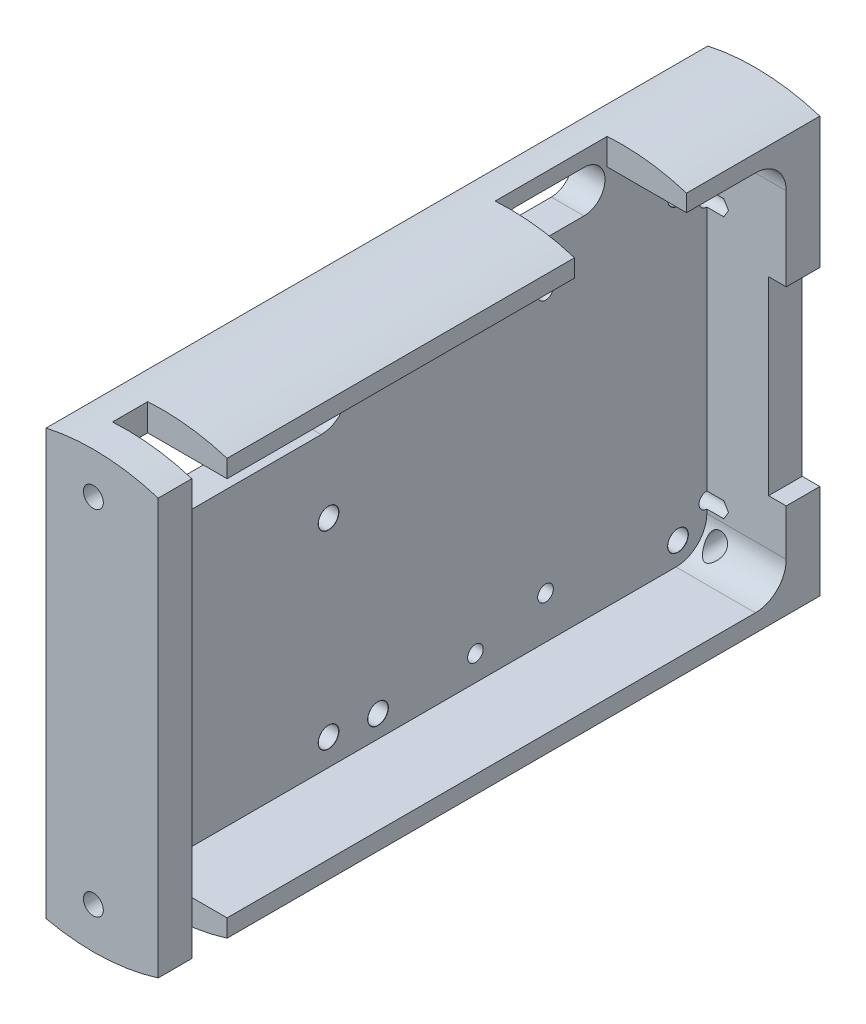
ISO-10303-21;
HEADER;
FILE_DESCRIPTION(('STEP AP214'),'2;1');
FILE_NAME('part.step','',(''),(''),'','','');
FILE_SCHEMA(('AUTOMOTIVE_DESIGN { 1 0 10303 214 1 1 1 1 }'));
ENDSEC;
DATA;
#1=APPLICATION_CONTEXT('core data for automotive mechanical design processes');
#2=APPLICATION_PROTOCOL_DEFINITION('international standard','automotive_design',2000,#1);
#3=PRODUCT_CONTEXT('',#1,'mechanical');
#4=PRODUCT('Part','Part','',(#3));
#5=PRODUCT_RELATED_PRODUCT_CATEGORY('part','',(#4));
#6=PRODUCT_DEFINITION_FORMATION('','',#4);
#7=PRODUCT_DEFINITION_CONTEXT('part definition',#1,'design');
#8=PRODUCT_DEFINITION('design','',#6,#7);
#9=PRODUCT_DEFINITION_SHAPE('','',#8);
#10=(LENGTH_UNIT() NAMED_UNIT(*) SI_UNIT(.MILLI.,.METRE.));
#11=(NAMED_UNIT(*) PLANE_ANGLE_UNIT() SI_UNIT($,.RADIAN.));
#12=(NAMED_UNIT(*) SI_UNIT($,.STERADIAN.) SOLID_ANGLE_UNIT());
#13=UNCERTAINTY_MEASURE_WITH_UNIT(LENGTH_MEASURE(1.E-05),#10,'distance_accuracy_value','');
#14=(GEOMETRIC_REPRESENTATION_CONTEXT(3) GLOBAL_UNCERTAINTY_ASSIGNED_CONTEXT((#13)) GLOBAL_UNIT_ASSIGNED_CONTEXT((#10,
#11,#12)) REPRESENTATION_CONTEXT('',''));
#15=CARTESIAN_POINT('',(0.,0.,0.));
#16=DIRECTION('',(0.,0.,1.));
#17=DIRECTION('',(1.,0.,0.));
#18=AXIS2_PLACEMENT_3D('',#15,#16,#17);
#19=CARTESIAN_POINT('',(10.,52.6548959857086,-27.48));
#20=DIRECTION('',(1.,0.,0.));
#21=DIRECTION('',(0.,0.,-1.));
#22=AXIS2_PLACEMENT_3D('',#19,#20,#21);
#23=CYLINDRICAL_SURFACE('',#22,3.);
#24=DIRECTION('',(-1.,0.,0.));
#25=VECTOR('',#24,1.);
#26=CARTESIAN_POINT('',(10.,49.6548959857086,-27.48));
#27=LINE('',#26,#25);
#28=CARTESIAN_POINT('',(3.7,49.6548959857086,-27.48));
#29=VERTEX_POINT('',#28);
#30=CARTESIAN_POINT('',(0.,49.6548959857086,-27.48));
#31=VERTEX_POINT('',#30);
#32=EDGE_CURVE('E530',#29,#31,#27,.T.);
#33=ORIENTED_EDGE('',*,*,#32,.F.);
#34=CARTESIAN_POINT('',(3.7,52.6548959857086,-27.48));
#35=DIRECTION('',(-1.,0.,0.));
#36=DIRECTION('',(0.,0.,1.));
#37=AXIS2_PLACEMENT_3D('',#34,#35,#36);
#38=CIRCLE('',#37,3.);
#39=CARTESIAN_POINT('',(3.7,52.6548959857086,-30.48));
#40=VERTEX_POINT('',#39);
#41=EDGE_CURVE('E62',#29,#40,#38,.F.);
#42=ORIENTED_EDGE('',*,*,#41,.T.);
#43=DIRECTION('',(-1.,0.,0.));
#44=VECTOR('',#43,1.);
#45=CARTESIAN_POINT('',(10.,52.6548959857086,-30.48));
#46=LINE('',#45,#44);
#47=CARTESIAN_POINT('',(0.,52.6548959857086,-30.48));
#48=VERTEX_POINT('',#47);
#49=EDGE_CURVE('E534',#48,#40,#46,.F.);
#50=ORIENTED_EDGE('',*,*,#49,.F.);
#51=CARTESIAN_POINT('',(0.,52.6548959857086,-27.48));
#52=DIRECTION('',(-1.,0.,0.));
#53=DIRECTION('',(0.,0.,1.));
#54=AXIS2_PLACEMENT_3D('',#51,#52,#53);
#55=CIRCLE('',#54,3.);
#56=EDGE_CURVE('E12',#48,#31,#55,.T.);
#57=ORIENTED_EDGE('',*,*,#56,.T.);
#58=EDGE_LOOP('',(#33,#42,#50,#57));
#59=FACE_BOUND('',#58,.T.);
#60=ADVANCED_FACE('F54',(#59),#23,.F.);
#61=CARTESIAN_POINT('',(10.,52.6548959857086,-6.81000000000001));
#62=DIRECTION('',(-1.,0.,0.));
#63=DIRECTION('',(0.,0.,1.));
#64=AXIS2_PLACEMENT_3D('',#61,#62,#63);
#65=CYLINDRICAL_SURFACE('',#64,3.);
#66=DIRECTION('',(1.,0.,0.));
#67=VECTOR('',#66,1.);
#68=CARTESIAN_POINT('',(10.,49.6548959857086,-6.81000000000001));
#69=LINE('',#68,#67);
#70=CARTESIAN_POINT('',(0.,49.6548959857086,-6.81000000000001));
#71=VERTEX_POINT('',#70);
#72=CARTESIAN_POINT('',(3.7,49.6548959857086,-6.81));
#73=VERTEX_POINT('',#72);
#74=EDGE_CURVE('E504',#71,#73,#69,.T.);
#75=ORIENTED_EDGE('',*,*,#74,.F.);
#76=CARTESIAN_POINT('',(0.,52.6548959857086,-6.81000000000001));
#77=DIRECTION('',(-1.,0.,0.));
#78=DIRECTION('',(0.,0.,1.));
#79=AXIS2_PLACEMENT_3D('',#76,#77,#78);
#80=CIRCLE('',#79,3.);
#81=CARTESIAN_POINT('',(0.,52.6548959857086,-3.81));
#82=VERTEX_POINT('',#81);
#83=EDGE_CURVE('E507',#71,#82,#80,.T.);
#84=ORIENTED_EDGE('',*,*,#83,.T.);
#85=DIRECTION('',(1.,0.,0.));
#86=VECTOR('',#85,1.);
#87=CARTESIAN_POINT('',(10.,52.6548959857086,-3.81));
#88=LINE('',#87,#86);
#89=CARTESIAN_POINT('',(3.7,52.6548959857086,-3.81));
#90=VERTEX_POINT('',#89);
#91=EDGE_CURVE('E514',#90,#82,#88,.F.);
#92=ORIENTED_EDGE('',*,*,#91,.F.);
#93=CARTESIAN_POINT('',(3.7,52.6548959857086,-6.81000000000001));
#94=DIRECTION('',(-1.,0.,0.));
#95=DIRECTION('',(0.,0.,1.));
#96=AXIS2_PLACEMENT_3D('',#93,#94,#95);
#97=CIRCLE('',#96,3.);
#98=EDGE_CURVE('E510',#90,#73,#97,.F.);
#99=ORIENTED_EDGE('',*,*,#98,.T.);
#100=EDGE_LOOP('',(#75,#84,#92,#99));
#101=FACE_BOUND('',#100,.T.);
#102=ADVANCED_FACE('F492',(#101),#65,.F.);
#103=CARTESIAN_POINT('',(3.7,56.6548959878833,-6.81));
#104=DIRECTION('',(1.,0.,0.));
#105=DIRECTION('',(0.,0.,-1.));
#106=AXIS2_PLACEMENT_3D('',#103,#104,#105);
#107=CYLINDRICAL_SURFACE('',#106,3.);
#108=DIRECTION('',(-1.,0.,0.));
#109=VECTOR('',#108,1.);
#110=CARTESIAN_POINT('',(3.7,59.6548959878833,-6.81));
#111=LINE('',#110,#109);
#112=CARTESIAN_POINT('',(3.7,59.6548959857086,-6.81));
#113=VERTEX_POINT('',#112);
#114=CARTESIAN_POINT('',(0.,59.6548959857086,-6.81000000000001));
#115=VERTEX_POINT('',#114);
#116=EDGE_CURVE('E562',#113,#115,#111,.T.);
#117=ORIENTED_EDGE('',*,*,#116,.F.);
#118=CARTESIAN_POINT('',(3.7,56.6548959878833,-6.81));
#119=DIRECTION('',(-1.,0.,0.));
#120=DIRECTION('',(0.,0.,1.));
#121=AXIS2_PLACEMENT_3D('',#118,#119,#120);
#122=CIRCLE('',#121,3.);
#123=CARTESIAN_POINT('',(3.7,56.6548959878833,-3.81));
#124=VERTEX_POINT('',#123);
#125=EDGE_CURVE('E522',#113,#124,#122,.F.);
#126=ORIENTED_EDGE('',*,*,#125,.T.);
#127=DIRECTION('',(-1.,0.,0.));
#128=VECTOR('',#127,1.);
#129=CARTESIAN_POINT('',(3.7,56.6548959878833,-3.81));
#130=LINE('',#129,#128);
#131=CARTESIAN_POINT('',(0.,56.6548959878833,-3.81));
#132=VERTEX_POINT('',#131);
#133=EDGE_CURVE('E557',#132,#124,#130,.F.);
#134=ORIENTED_EDGE('',*,*,#133,.F.);
#135=CARTESIAN_POINT('',(0.,56.6548959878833,-6.81));
#136=DIRECTION('',(-1.,0.,0.));
#137=DIRECTION('',(0.,0.,1.));
#138=AXIS2_PLACEMENT_3D('',#135,#136,#137);
#139=CIRCLE('',#138,3.);
#140=EDGE_CURVE('E515',#132,#115,#139,.T.);
#141=ORIENTED_EDGE('',*,*,#140,.T.);
#142=EDGE_LOOP('',(#117,#126,#134,#141));
#143=FACE_BOUND('',#142,.T.);
#144=ADVANCED_FACE('F489',(#143),#107,.F.);
#145=CARTESIAN_POINT('',(10.,56.6548959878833,-27.48));
#146=DIRECTION('',(1.,0.,0.));
#147=DIRECTION('',(0.,0.,-1.));
#148=AXIS2_PLACEMENT_3D('',#145,#146,#147);
#149=CYLINDRICAL_SURFACE('',#148,3.);
#150=DIRECTION('',(-1.,0.,0.));
#151=VECTOR('',#150,1.);
#152=CARTESIAN_POINT('',(10.,56.6548959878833,-30.48));
#153=LINE('',#152,#151);
#154=CARTESIAN_POINT('',(3.7,56.6548959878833,-30.48));
#155=VERTEX_POINT('',#154);
#156=CARTESIAN_POINT('',(0.,56.6548959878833,-30.48));
#157=VERTEX_POINT('',#156);
#158=EDGE_CURVE('E585',#155,#157,#153,.T.);
#159=ORIENTED_EDGE('',*,*,#158,.F.);
#160=CARTESIAN_POINT('',(3.7,56.6548959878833,-27.48));
#161=DIRECTION('',(-1.,0.,0.));
#162=DIRECTION('',(0.,0.,1.));
#163=AXIS2_PLACEMENT_3D('',#160,#161,#162);
#164=CIRCLE('',#163,3.);
#165=CARTESIAN_POINT('',(3.7,59.6548959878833,-27.48));
#166=VERTEX_POINT('',#165);
#167=EDGE_CURVE('E573',#155,#166,#164,.F.);
#168=ORIENTED_EDGE('',*,*,#167,.T.);
#169=DIRECTION('',(-1.,0.,0.));
#170=VECTOR('',#169,1.);
#171=CARTESIAN_POINT('',(10.,59.6548959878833,-27.48));
#172=LINE('',#171,#170);
#173=CARTESIAN_POINT('',(0.,59.6548959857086,-27.48));
#174=VERTEX_POINT('',#173);
#175=EDGE_CURVE('E579',#174,#166,#172,.F.);
#176=ORIENTED_EDGE('',*,*,#175,.F.);
#177=CARTESIAN_POINT('',(0.,56.6548959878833,-27.48));
#178=DIRECTION('',(-1.,0.,0.));
#179=DIRECTION('',(0.,0.,1.));
#180=AXIS2_PLACEMENT_3D('',#177,#178,#179);
#181=CIRCLE('',#180,3.);
#182=EDGE_CURVE('E568',#174,#157,#181,.T.);
#183=ORIENTED_EDGE('',*,*,#182,.T.);
#184=EDGE_LOOP('',(#159,#168,#176,#183));
#185=FACE_BOUND('',#184,.T.);
#186=ADVANCED_FACE('F485',(#185),#149,.F.);
#187=CARTESIAN_POINT('',(3.7,0.,0.));
#188=DIRECTION('',(-1.,0.,0.));
#189=DIRECTION('',(0.,0.,1.));
#190=AXIS2_PLACEMENT_3D('',#187,#188,#189);
#191=PLANE('',#190);
#192=DIRECTION('',(0.,-1.,0.));
#193=VECTOR('',#192,1.);
#194=CARTESIAN_POINT('',(3.7,60.6181976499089,-3.81));
#195=LINE('',#194,#193);
#196=CARTESIAN_POINT('',(3.7,62.7197710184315,-3.81));
#197=VERTEX_POINT('',#196);
#198=EDGE_CURVE('E934',#197,#124,#195,.T.);
#199=ORIENTED_EDGE('',*,*,#198,.T.);
#200=ORIENTED_EDGE('',*,*,#125,.F.);
#201=DIRECTION('',(0.,0.,-1.));
#202=VECTOR('',#201,1.);
#203=CARTESIAN_POINT('',(3.7,59.6548959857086,0.));
#204=LINE('',#203,#202);
#205=CARTESIAN_POINT('',(3.7,59.6548959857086,-7.81000000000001));
#206=VERTEX_POINT('',#205);
#207=EDGE_CURVE('E591',#113,#206,#204,.T.);
#208=ORIENTED_EDGE('',*,*,#207,.T.);
#209=DIRECTION('',(0.,1.,0.));
#210=VECTOR('',#209,1.);
#211=CARTESIAN_POINT('',(3.7,67.665830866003,-7.80999999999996));
#212=LINE('',#211,#210);
#213=CARTESIAN_POINT('',(3.7,62.7197710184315,-7.80999999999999));
#214=VERTEX_POINT('',#213);
#215=EDGE_CURVE('E881',#206,#214,#212,.T.);
#216=ORIENTED_EDGE('',*,*,#215,.T.);
#217=DIRECTION('',(0.,0.,1.));
#218=VECTOR('',#217,1.);
#219=CARTESIAN_POINT('',(3.7,62.7197710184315,-75.));
#220=LINE('',#219,#218);
#221=EDGE_CURVE('E854',#214,#197,#220,.T.);
#222=ORIENTED_EDGE('',*,*,#221,.T.);
#223=EDGE_LOOP('',(#199,#200,#208,#216,#222));
#224=FACE_BOUND('',#223,.T.);
#225=ADVANCED_FACE('F488',(#224),#191,.F.);
#226=CARTESIAN_POINT('',(12.7,0.,0.));
#227=DIRECTION('',(-1.,0.,0.));
#228=DIRECTION('',(0.,0.,1.));
#229=AXIS2_PLACEMENT_3D('',#226,#227,#228);
#230=PLANE('',#229);
#231=DIRECTION('',(0.,1.,0.));
#232=VECTOR('',#231,1.);
#233=CARTESIAN_POINT('',(12.7,59.7292618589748,-71.19));
#234=LINE('',#233,#232);
#235=CARTESIAN_POINT('',(12.7,46.7951040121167,-71.19));
#236=VERTEX_POINT('',#235);
#237=CARTESIAN_POINT('',(12.7,56.2292618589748,-71.19));
#238=VERTEX_POINT('',#237);
#239=EDGE_CURVE('E975',#236,#238,#234,.T.);
#240=ORIENTED_EDGE('',*,*,#239,.F.);
#241=DIRECTION('',(0.,0.,1.));
#242=VECTOR('',#241,1.);
#243=CARTESIAN_POINT('',(12.7,46.7951040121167,-66.5831136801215));
#244=LINE('',#243,#242);
#245=CARTESIAN_POINT('',(12.7,46.7951040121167,-75.));
#246=VERTEX_POINT('',#245);
#247=EDGE_CURVE('E404',#246,#236,#244,.T.);
#248=ORIENTED_EDGE('',*,*,#247,.F.);
#249=DIRECTION('',(0.,1.,0.));
#250=VECTOR('',#249,1.);
#251=CARTESIAN_POINT('',(12.7,0.,-75.));
#252=LINE('',#251,#250);
#253=CARTESIAN_POINT('',(12.7,61.6548959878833,-75.));
#254=VERTEX_POINT('',#253);
#255=EDGE_CURVE('E776',#246,#254,#252,.T.);
#256=ORIENTED_EDGE('',*,*,#255,.T.);
#257=DIRECTION('',(0.,0.,1.));
#258=VECTOR('',#257,1.);
#259=CARTESIAN_POINT('',(12.7,61.6548959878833,-75.));
#260=LINE('',#259,#258);
#261=CARTESIAN_POINT('',(12.7,61.6548959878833,-59.89));
#262=VERTEX_POINT('',#261);
#263=EDGE_CURVE('E816',#262,#254,#260,.F.);
#264=ORIENTED_EDGE('',*,*,#263,.F.);
#265=DIRECTION('',(0.,1.,0.));
#266=VECTOR('',#265,1.);
#267=CARTESIAN_POINT('',(12.7,59.7292618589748,-59.89));
#268=LINE('',#267,#266);
#269=CARTESIAN_POINT('',(12.7,59.7292618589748,-59.89));
#270=VERTEX_POINT('',#269);
#271=EDGE_CURVE('E959',#270,#262,#268,.T.);
#272=ORIENTED_EDGE('',*,*,#271,.F.);
#273=DIRECTION('',(0.,0.,1.));
#274=VECTOR('',#273,1.);
#275=CARTESIAN_POINT('',(12.7,59.7292618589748,-71.19));
#276=LINE('',#275,#274);
#277=CARTESIAN_POINT('',(12.7,59.7292618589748,-67.69));
#278=VERTEX_POINT('',#277);
#279=EDGE_CURVE('E964',#278,#270,#276,.T.);
#280=ORIENTED_EDGE('',*,*,#279,.F.);
#281=CARTESIAN_POINT('',(12.7,56.2292618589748,-67.69));
#282=DIRECTION('',(-1.,0.,0.));
#283=DIRECTION('',(0.,0.,1.));
#284=AXIS2_PLACEMENT_3D('',#281,#282,#283);
#285=CIRCLE('',#284,3.5);
#286=EDGE_CURVE('E705',#238,#278,#285,.F.);
#287=ORIENTED_EDGE('',*,*,#286,.F.);
#288=EDGE_LOOP('',(#240,#248,#256,#264,#272,#280,#287));
#289=FACE_BOUND('',#288,.T.);
#290=ADVANCED_FACE('F483',(#289),#230,.F.);
#291=CARTESIAN_POINT('',(3.7,20.0451040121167,-67.69));
#292=DIRECTION('',(-1.,0.,0.));
#293=DIRECTION('',(0.,0.,1.));
#294=AXIS2_PLACEMENT_3D('',#291,#292,#293);
#295=CYLINDRICAL_SURFACE('',#294,3.5);
#296=CARTESIAN_POINT('',(4.21970000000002,18.1,-70.5997371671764));
#297=CARTESIAN_POINT('',(4.21969934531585,18.1610829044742,-70.6405769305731));
#298=CARTESIAN_POINT('',(4.22465272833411,18.2234567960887,-70.6794664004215));
#299=CARTESIAN_POINT('',(4.24566599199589,18.349147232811,-70.7525136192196));
#300=CARTESIAN_POINT('',(4.26171954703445,18.4124632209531,-70.7866740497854));
#301=CARTESIAN_POINT('',(4.30592806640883,18.5381270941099,-70.849746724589));
#302=CARTESIAN_POINT('',(4.33416514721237,18.6004653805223,-70.8786214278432));
#303=CARTESIAN_POINT('',(4.40287557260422,18.7207407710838,-70.9304242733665));
#304=CARTESIAN_POINT('',(4.4433427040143,18.7786800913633,-70.9533554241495));
#305=CARTESIAN_POINT('',(4.53033094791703,18.8808315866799,-70.9910756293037));
#306=CARTESIAN_POINT('',(4.57562923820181,18.9258558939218,-71.0064961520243));
#307=CARTESIAN_POINT('',(4.6739199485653,19.0080716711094,-71.0331175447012));
#308=CARTESIAN_POINT('',(4.72691020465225,19.0452653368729,-71.0443195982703));
#309=CARTESIAN_POINT('',(4.83588969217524,19.1084747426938,-71.0624994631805));
#310=CARTESIAN_POINT('',(4.89155790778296,19.1349893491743,-71.0696742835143));
#311=CARTESIAN_POINT('',(5.00672524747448,19.1786715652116,-71.0811366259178));
#312=CARTESIAN_POINT('',(5.06622409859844,19.1958398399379,-71.0854243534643));
#313=CARTESIAN_POINT('',(5.18710419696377,19.220191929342,-71.0914229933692));
#314=CARTESIAN_POINT('',(5.24847692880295,19.2274155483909,-71.0931441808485));
#315=CARTESIAN_POINT('',(5.37160150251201,19.2317712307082,-71.0941878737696));
#316=CARTESIAN_POINT('',(5.43335335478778,19.2289030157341,-71.0935103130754));
#317=CARTESIAN_POINT('',(5.55568053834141,19.2131433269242,-71.0896920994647));
#318=CARTESIAN_POINT('',(5.61625169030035,19.2002212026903,-71.0865439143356));
#319=CARTESIAN_POINT('',(5.73429236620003,19.1647510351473,-71.0775228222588));
#320=CARTESIAN_POINT('',(5.79176201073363,19.142203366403,-71.0716500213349));
#321=CARTESIAN_POINT('',(5.90185021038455,19.0883254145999,-71.0568011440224));
#322=CARTESIAN_POINT('',(5.95447800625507,19.0570123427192,-71.0478311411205));
#323=CARTESIAN_POINT('',(6.0535304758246,18.9867409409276,-71.0263471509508));
#324=CARTESIAN_POINT('',(6.09995586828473,18.9477834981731,-71.0138335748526));
#325=CARTESIAN_POINT('',(6.18535905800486,18.8637651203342,-70.9849058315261));
#326=CARTESIAN_POINT('',(6.22434610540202,18.8187118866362,-70.9684965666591));
#327=CARTESIAN_POINT('',(6.29414687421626,18.7241937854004,-70.9315686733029));
#328=CARTESIAN_POINT('',(6.32496022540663,18.6747287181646,-70.9110498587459));
#329=CARTESIAN_POINT('',(6.37880952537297,18.5717996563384,-70.8653153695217));
#330=CARTESIAN_POINT('',(6.4016102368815,18.5182633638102,-70.8399867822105));
#331=CARTESIAN_POINT('',(6.43838607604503,18.410247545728,-70.7853051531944));
#332=CARTESIAN_POINT('',(6.45235855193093,18.3557677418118,-70.7559509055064));
#333=CARTESIAN_POINT('',(6.47293704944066,18.2422263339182,-70.6907183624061));
#334=CARTESIAN_POINT('',(6.47871741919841,18.1832209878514,-70.654485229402));
#335=CARTESIAN_POINT('',(6.48131672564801,18.0673560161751,-70.5784827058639));
#336=CARTESIAN_POINT('',(6.47812993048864,18.0104977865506,-70.5387110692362));
#337=CARTESIAN_POINT('',(6.4606478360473,17.8751650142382,-70.437960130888));
#338=CARTESIAN_POINT('',(6.44202593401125,17.7983811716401,-70.3754440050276));
#339=CARTESIAN_POINT('',(6.39097035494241,17.6528603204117,-70.2466919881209));
#340=CARTESIAN_POINT('',(6.35850399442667,17.5841428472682,-70.1804476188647));
#341=CARTESIAN_POINT('',(6.28099553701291,17.4545409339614,-70.0453860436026));
#342=CARTESIAN_POINT('',(6.2357735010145,17.393788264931,-69.9765452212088));
#343=CARTESIAN_POINT('',(6.15916243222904,17.3098982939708,-69.8741718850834));
#344=CARTESIAN_POINT('',(6.1321776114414,17.2831526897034,-69.8402116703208));
#345=CARTESIAN_POINT('',(6.07515387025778,17.2321324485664,-69.7730181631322));
#346=CARTESIAN_POINT('',(6.04511647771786,17.2078565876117,-69.7397845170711));
#347=CARTESIAN_POINT('',(5.97849321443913,17.1595533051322,-69.6712945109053));
#348=CARTESIAN_POINT('',(5.9415515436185,17.1358086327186,-69.6361820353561));
#349=CARTESIAN_POINT('',(5.86311746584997,17.0918783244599,-69.5688469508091));
#350=CARTESIAN_POINT('',(5.82162700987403,17.0716911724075,-69.5366231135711));
#351=CARTESIAN_POINT('',(5.74314337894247,17.0396259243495,-69.483832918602));
#352=CARTESIAN_POINT('',(5.70718492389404,17.0268975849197,-69.4622645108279));
#353=CARTESIAN_POINT('',(5.63185029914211,17.0047052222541,-69.4239161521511));
#354=CARTESIAN_POINT('',(5.59248248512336,16.995233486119,-69.4071249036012));
#355=CARTESIAN_POINT('',(5.52153751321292,16.9823754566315,-69.3840547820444));
#356=CARTESIAN_POINT('',(5.490664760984,16.978041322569,-69.3761687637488));
#357=CARTESIAN_POINT('',(5.4278537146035,16.9719448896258,-69.365032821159));
#358=CARTESIAN_POINT('',(5.39591692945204,16.9701790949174,-69.3617765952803));
#359=CARTESIAN_POINT('',(5.33179896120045,16.969390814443,-69.3603261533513));
#360=CARTESIAN_POINT('',(5.29961734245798,16.9703760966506,-69.3621462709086));
#361=CARTESIAN_POINT('',(5.23608912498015,16.9750019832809,-69.3706234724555));
#362=CARTESIAN_POINT('',(5.2047435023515,16.978645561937,-69.3772859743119));
#363=CARTESIAN_POINT('',(5.13423451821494,16.9897483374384,-69.3973273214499));
#364=CARTESIAN_POINT('',(5.09561666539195,16.9980343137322,-69.4121381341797));
#365=CARTESIAN_POINT('',(5.02151709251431,17.0178000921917,-69.4466526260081));
#366=CARTESIAN_POINT('',(4.98604396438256,17.0292883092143,-69.4663691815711));
#367=CARTESIAN_POINT('',(4.89422661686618,17.0638140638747,-69.5240338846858));
#368=CARTESIAN_POINT('',(4.84075858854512,17.0892904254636,-69.5650490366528));
#369=CARTESIAN_POINT('',(4.74108265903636,17.1460128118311,-69.6516279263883));
#370=CARTESIAN_POINT('',(4.69489619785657,17.1772753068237,-69.6972044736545));
#371=CARTESIAN_POINT('',(4.61819444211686,17.237524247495,-69.7803426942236));
#372=CARTESIAN_POINT('',(4.58645396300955,17.2655309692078,-69.8174958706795));
#373=CARTESIAN_POINT('',(4.52662737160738,17.3244996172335,-69.892405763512));
#374=CARTESIAN_POINT('',(4.49854308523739,17.3554630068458,-69.9301627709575));
#375=CARTESIAN_POINT('',(4.41966651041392,17.4526724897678,-70.0435447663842));
#376=CARTESIAN_POINT('',(4.37422641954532,17.5232570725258,-70.1193078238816));
#377=CARTESIAN_POINT('',(4.30000793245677,17.6734533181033,-70.266057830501));
#378=CARTESIAN_POINT('',(4.27086605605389,17.7528163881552,-70.3371149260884));
#379=CARTESIAN_POINT('',(4.23074107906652,17.9205134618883,-70.4734640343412));
#380=CARTESIAN_POINT('',(4.21970097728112,18.0088183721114,-70.5387735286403));
#381=CARTESIAN_POINT('',(4.21970000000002,18.1,-70.5997371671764));
#382=B_SPLINE_CURVE_WITH_KNOTS('',3,(#296,#297,#298,#299,#300,#301,#302,#303,#304,#305,#306,
#307,#308,#309,#310,#311,#312,#313,#314,#315,#316,#317,#318,#319,#320,#321,#322,#323,#324,#325,
#326,#327,#328,#329,#330,#331,#332,#333,#334,#335,#336,#337,#338,#339,#340,#341,#342,#343,#344,
#345,#346,#347,#348,#349,#350,#351,#352,#353,#354,#355,#356,#357,#358,#359,#360,#361,#362,#363,
#364,#365,#366,#367,#368,#369,#370,#371,#372,#373,#374,#375,#376,#377,#378,#379,#380,#381),
.UNSPECIFIED.,.T.,.F.,(4,2,2,2,2,2,2,2,2,2,2,2,2,2,2,2,2,2,2,2,2,2,2,2,2,2,2,2,2,2,2,2,2,2,2,2,
2,2,2,2,2,2,4),(0.,0.22016206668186,0.440198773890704,0.661742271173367,0.883173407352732,
1.07926358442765,1.2752987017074,1.46064594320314,1.645979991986,1.83057004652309,
2.01516519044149,2.20032530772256,2.38547822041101,2.57027009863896,2.75504054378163,
2.93957969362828,3.12412720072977,3.31371186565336,3.50335344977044,3.7110060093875,
3.91879133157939,4.21940265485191,4.5207276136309,4.82653630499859,4.97929262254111,
5.13197285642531,5.30036801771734,5.46869123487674,5.59978847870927,5.73057305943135,
5.82665650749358,5.9226090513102,6.01883280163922,6.11516437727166,6.24099592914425,
6.36716131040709,6.58209671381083,6.79765361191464,6.96640590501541,7.135242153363,
7.47279303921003,7.80248057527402,8.13112794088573),.UNSPECIFIED.);
#383=CARTESIAN_POINT('',(4.21970000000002,18.1,-70.5997371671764));
#384=VERTEX_POINT('',#383);
#385=EDGE_CURVE('E466',#384,#384,#382,.T.);
#386=ORIENTED_EDGE('',*,*,#385,.T.);
#387=EDGE_LOOP('',(#386));
#388=FACE_BOUND('',#387,.T.);
#389=DIRECTION('',(1.,0.,0.));
#390=VECTOR('',#389,1.);
#391=CARTESIAN_POINT('',(3.7,20.0451040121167,-71.19));
#392=LINE('',#391,#390);
#393=CARTESIAN_POINT('',(3.7,20.0451040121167,-71.19));
#394=VERTEX_POINT('',#393);
#395=CARTESIAN_POINT('',(12.7,20.0451040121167,-71.19));
#396=VERTEX_POINT('',#395);
#397=EDGE_CURVE('E699',#394,#396,#392,.T.);
#398=ORIENTED_EDGE('',*,*,#397,.F.);
#399=CARTESIAN_POINT('',(3.7,20.0451040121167,-67.69));
#400=DIRECTION('',(-1.,0.,0.));
#401=DIRECTION('',(0.,0.,1.));
#402=AXIS2_PLACEMENT_3D('',#399,#400,#401);
#403=CIRCLE('',#402,3.5);
#404=CARTESIAN_POINT('',(3.7,16.5451040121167,-67.69));
#405=VERTEX_POINT('',#404);
#406=EDGE_CURVE('E690',#405,#394,#403,.F.);
#407=ORIENTED_EDGE('',*,*,#406,.F.);
#408=DIRECTION('',(1.,0.,0.));
#409=VECTOR('',#408,1.);
#410=CARTESIAN_POINT('',(3.7,16.5451040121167,-67.69));
#411=LINE('',#410,#409);
#412=CARTESIAN_POINT('',(12.7,16.5451040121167,-67.69));
#413=VERTEX_POINT('',#412);
#414=EDGE_CURVE('E694',#413,#405,#411,.F.);
#415=ORIENTED_EDGE('',*,*,#414,.F.);
#416=CARTESIAN_POINT('',(12.7,20.0451040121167,-67.69));
#417=DIRECTION('',(-1.,0.,0.));
#418=DIRECTION('',(0.,0.,1.));
#419=AXIS2_PLACEMENT_3D('',#416,#417,#418);
#420=CIRCLE('',#419,3.5);
#421=EDGE_CURVE('E476',#413,#396,#420,.F.);
#422=ORIENTED_EDGE('',*,*,#421,.T.);
#423=EDGE_LOOP('',(#398,#407,#415,#422));
#424=FACE_BOUND('',#423,.T.);
#425=ADVANCED_FACE('F479',(#388,#424),#295,.F.);
#426=CARTESIAN_POINT('',(3.7,56.2292618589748,-67.69));
#427=DIRECTION('',(-1.,0.,0.));
#428=DIRECTION('',(0.,0.,1.));
#429=AXIS2_PLACEMENT_3D('',#426,#427,#428);
#430=CYLINDRICAL_SURFACE('',#429,3.5);
#431=CARTESIAN_POINT('',(4.21970000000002,58.1,-70.6480971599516));
#432=CARTESIAN_POINT('',(4.21970234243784,58.1812281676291,-70.5967195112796));
#433=CARTESIAN_POINT('',(4.22847131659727,58.2603876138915,-70.5419243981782));
#434=CARTESIAN_POINT('',(4.26085091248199,58.4120701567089,-70.4275979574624));
#435=CARTESIAN_POINT('',(4.28450533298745,58.4845729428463,-70.368053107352));
#436=CARTESIAN_POINT('',(4.34284155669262,58.6178894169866,-70.2496810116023));
#437=CARTESIAN_POINT('',(4.37685183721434,58.6791248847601,-70.190991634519));
#438=CARTESIAN_POINT('',(4.45513517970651,58.7939972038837,-70.0730439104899));
#439=CARTESIAN_POINT('',(4.49940631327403,58.8476354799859,-70.0137856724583));
#440=CARTESIAN_POINT('',(4.5916519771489,58.9403510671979,-69.9045976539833));
#441=CARTESIAN_POINT('',(4.63839200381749,58.9804150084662,-69.854458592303));
#442=CARTESIAN_POINT('',(4.74022273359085,59.0537750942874,-69.7577919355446));
#443=CARTESIAN_POINT('',(4.79529566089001,59.0870853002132,-69.7112569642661));
#444=CARTESIAN_POINT('',(4.88954795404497,59.1329623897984,-69.644331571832));
#445=CARTESIAN_POINT('',(4.92546224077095,59.1483107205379,-69.6212665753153));
#446=CARTESIAN_POINT('',(5.00075986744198,59.175737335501,-69.5791554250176));
#447=CARTESIAN_POINT('',(5.04013803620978,59.1878203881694,-69.5601034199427));
#448=CARTESIAN_POINT('',(5.11401890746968,59.2059071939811,-69.5311453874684));
#449=CARTESIAN_POINT('',(5.14791391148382,59.2126443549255,-69.5201711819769));
#450=CARTESIAN_POINT('',(5.21736503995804,59.2230376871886,-69.5031210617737));
#451=CARTESIAN_POINT('',(5.25291856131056,59.2266985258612,-69.4970377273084));
#452=CARTESIAN_POINT('',(5.32497348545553,59.2306011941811,-69.4905496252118));
#453=CARTESIAN_POINT('',(5.36147939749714,59.2308216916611,-69.4901802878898));
#454=CARTESIAN_POINT('',(5.43393715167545,59.2277637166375,-69.4952683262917));
#455=CARTESIAN_POINT('',(5.46988856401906,59.2244826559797,-69.5007300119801));
#456=CARTESIAN_POINT('',(5.54558103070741,59.2140038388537,-69.5179574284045));
#457=CARTESIAN_POINT('',(5.58505166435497,59.20628016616,-69.5305653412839));
#458=CARTESIAN_POINT('',(5.66111032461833,59.187351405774,-69.5608353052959));
#459=CARTESIAN_POINT('',(5.69769174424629,59.1761386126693,-69.5785085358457));
#460=CARTESIAN_POINT('',(5.78878632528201,59.1433576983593,-69.628915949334));
#461=CARTESIAN_POINT('',(5.84099212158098,59.119600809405,-69.6643485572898));
#462=CARTESIAN_POINT('',(5.93869670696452,59.0664969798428,-69.739939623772));
#463=CARTESIAN_POINT('',(5.98417635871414,59.0371346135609,-69.7801110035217));
#464=CARTESIAN_POINT('',(6.05972896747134,58.9806588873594,-69.8536697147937));
#465=CARTESIAN_POINT('',(6.0909820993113,58.9544903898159,-69.886586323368));
#466=CARTESIAN_POINT('',(6.15007886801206,58.8994272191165,-69.9532034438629));
#467=CARTESIAN_POINT('',(6.1779208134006,58.8705312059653,-69.9869043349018));
#468=CARTESIAN_POINT('',(6.25648597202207,58.7799013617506,-70.0884241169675));
#469=CARTESIAN_POINT('',(6.30225315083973,58.7142221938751,-70.1566648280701));
#470=CARTESIAN_POINT('',(6.38023092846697,58.5720883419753,-70.2921099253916));
#471=CARTESIAN_POINT('',(6.41222683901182,58.4954861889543,-70.3592831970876));
#472=CARTESIAN_POINT('',(6.45911233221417,58.3334802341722,-70.4887357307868));
#473=CARTESIAN_POINT('',(6.47404823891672,58.2481009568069,-70.55102781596));
#474=CARTESIAN_POINT('',(6.48198418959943,58.0980071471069,-70.6502854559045));
#475=CARTESIAN_POINT('',(6.48025422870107,58.0348569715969,-70.6892110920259));
#476=CARTESIAN_POINT('',(6.4655770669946,57.9071620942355,-70.762465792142));
#477=CARTESIAN_POINT('',(6.45263631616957,57.8426182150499,-70.7967974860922));
#478=CARTESIAN_POINT('',(6.41446661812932,57.7139710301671,-70.8603029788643));
#479=CARTESIAN_POINT('',(6.38915295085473,57.6498738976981,-70.8894392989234));
#480=CARTESIAN_POINT('',(6.32593561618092,57.5255625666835,-70.941791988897));
#481=CARTESIAN_POINT('',(6.2880388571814,57.4653462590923,-70.965011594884));
#482=CARTESIAN_POINT('',(6.20553619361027,57.3586198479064,-71.0032148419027));
#483=CARTESIAN_POINT('',(6.16223219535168,57.311330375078,-71.0188439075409));
#484=CARTESIAN_POINT('',(6.06750824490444,57.2242758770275,-71.0458945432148));
#485=CARTESIAN_POINT('',(6.01609064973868,57.1845086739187,-71.0573173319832));
#486=CARTESIAN_POINT('',(5.90980147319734,57.1161457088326,-71.0759454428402));
#487=CARTESIAN_POINT('',(5.85528721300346,57.0870471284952,-71.0833519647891));
#488=CARTESIAN_POINT('',(5.74198459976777,57.0380515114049,-71.0953632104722));
#489=CARTESIAN_POINT('',(5.68319653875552,57.0181538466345,-71.0999681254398));
#490=CARTESIAN_POINT('',(5.5632223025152,56.9882785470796,-71.1067425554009));
#491=CARTESIAN_POINT('',(5.50204445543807,56.9782691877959,-71.1089198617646));
#492=CARTESIAN_POINT('',(5.37883541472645,56.9683789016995,-71.1110717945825));
#493=CARTESIAN_POINT('',(5.3168041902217,56.9684983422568,-71.1110463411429));
#494=CARTESIAN_POINT('',(5.19336218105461,56.9788863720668,-71.1087850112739));
#495=CARTESIAN_POINT('',(5.13195531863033,56.9891995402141,-71.106539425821));
#496=CARTESIAN_POINT('',(5.01179012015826,57.0197063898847,-71.0996099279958));
#497=CARTESIAN_POINT('',(4.9530317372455,57.0398998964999,-71.0949260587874));
#498=CARTESIAN_POINT('',(4.83992992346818,57.0894495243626,-71.0827457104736));
#499=CARTESIAN_POINT('',(4.78558014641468,57.1187921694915,-71.0752533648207));
#500=CARTESIAN_POINT('',(4.68275361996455,57.1856048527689,-71.0569871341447));
#501=CARTESIAN_POINT('',(4.63427605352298,57.2230737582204,-71.0462137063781));
#502=CARTESIAN_POINT('',(4.544703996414,57.3045594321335,-71.0209969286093));
#503=CARTESIAN_POINT('',(4.50357716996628,57.3485458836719,-71.0065703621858));
#504=CARTESIAN_POINT('',(4.42938300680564,57.4415312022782,-70.9737219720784));
#505=CARTESIAN_POINT('',(4.39631645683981,57.4905305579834,-70.9552997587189));
#506=CARTESIAN_POINT('',(4.33829026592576,57.5925350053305,-70.914059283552));
#507=CARTESIAN_POINT('',(4.31346776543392,57.6455913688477,-70.8911758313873));
#508=CARTESIAN_POINT('',(4.27269403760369,57.7531593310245,-70.8413878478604));
#509=CARTESIAN_POINT('',(4.25674006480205,57.80767047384,-70.8144845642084));
#510=CARTESIAN_POINT('',(4.23639417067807,57.9021562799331,-70.7646514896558));
#511=CARTESIAN_POINT('',(4.23006155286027,57.9421682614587,-70.7425485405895));
#512=CARTESIAN_POINT('',(4.2217141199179,58.0216120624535,-70.6965913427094));
#513=CARTESIAN_POINT('',(4.21969887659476,58.0610439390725,-70.6727372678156));
#514=CARTESIAN_POINT('',(4.21970000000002,58.1,-70.6480971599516));
#515=B_SPLINE_CURVE_WITH_KNOTS('',3,(#431,#432,#433,#434,#435,#436,#437,#438,#439,#440,#441,
#442,#443,#444,#445,#446,#447,#448,#449,#450,#451,#452,#453,#454,#455,#456,#457,#458,#459,#460,
#461,#462,#463,#464,#465,#466,#467,#468,#469,#470,#471,#472,#473,#474,#475,#476,#477,#478,#479,
#480,#481,#482,#483,#484,#485,#486,#487,#488,#489,#490,#491,#492,#493,#494,#495,#496,#497,#498,
#499,#500,#501,#502,#503,#504,#505,#506,#507,#508,#509,#510,#511,#512,#513,#514),.UNSPECIFIED.,
.T.,.F.,(4,2,2,2,2,2,2,2,2,2,2,2,2,2,2,2,2,2,2,2,2,2,2,2,2,2,2,2,2,2,2,2,2,2,2,2,2,2,2,2,2,4),
(0.,0.288139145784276,0.577130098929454,0.85036529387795,1.12354917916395,1.36113161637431,
1.59821420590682,1.73398462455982,1.86955568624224,1.97791723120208,2.08611407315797,
2.19498153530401,2.30392952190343,2.42967644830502,2.55570307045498,2.75684341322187,
2.95854546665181,3.11552491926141,3.27258189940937,3.58667362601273,3.90549864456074,
4.22345586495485,4.44520328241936,4.6668232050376,4.88998232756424,5.11301913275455,
5.30998687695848,5.5068975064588,5.69272454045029,5.87853888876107,6.06375513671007,
6.24897810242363,6.43501467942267,6.6210479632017,6.80680851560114,6.99254319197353,
7.17743955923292,7.36235396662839,7.55020611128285,7.73800006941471,7.87620187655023,
8.01438997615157),.UNSPECIFIED.);
#516=CARTESIAN_POINT('',(4.21970000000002,58.1,-70.6480971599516));
#517=VERTEX_POINT('',#516);
#518=EDGE_CURVE('E432',#517,#517,#515,.T.);
#519=ORIENTED_EDGE('',*,*,#518,.T.);
#520=EDGE_LOOP('',(#519));
#521=FACE_BOUND('',#520,.T.);
#522=DIRECTION('',(1.,0.,0.));
#523=VECTOR('',#522,1.);
#524=CARTESIAN_POINT('',(3.7,59.7292618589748,-67.69));
#525=LINE('',#524,#523);
#526=CARTESIAN_POINT('',(3.7,59.7292618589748,-67.69));
#527=VERTEX_POINT('',#526);
#528=EDGE_CURVE('E721',#527,#278,#525,.T.);
#529=ORIENTED_EDGE('',*,*,#528,.F.);
#530=CARTESIAN_POINT('',(3.7,56.2292618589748,-67.69));
#531=DIRECTION('',(-1.,0.,0.));
#532=DIRECTION('',(0.,0.,1.));
#533=AXIS2_PLACEMENT_3D('',#530,#531,#532);
#534=CIRCLE('',#533,3.5);
#535=CARTESIAN_POINT('',(3.7,56.2292618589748,-71.19));
#536=VERTEX_POINT('',#535);
#537=EDGE_CURVE('E710',#536,#527,#534,.F.);
#538=ORIENTED_EDGE('',*,*,#537,.F.);
#539=DIRECTION('',(1.,0.,0.));
#540=VECTOR('',#539,1.);
#541=CARTESIAN_POINT('',(3.7,56.2292618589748,-71.19));
#542=LINE('',#541,#540);
#543=EDGE_CURVE('E715',#238,#536,#542,.F.);
#544=ORIENTED_EDGE('',*,*,#543,.F.);
#545=ORIENTED_EDGE('',*,*,#286,.T.);
#546=EDGE_LOOP('',(#529,#538,#544,#545));
#547=FACE_BOUND('',#546,.T.);
#548=ADVANCED_FACE('F443',(#521,#547),#430,.F.);
#549=CARTESIAN_POINT('',(12.7,61.6548959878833,-7.81));
#550=VERTEX_POINT('',#549);
#551=CARTESIAN_POINT('',(12.7,61.6548959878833,-47.19));
#552=VERTEX_POINT('',#551);
#553=EDGE_CURVE('E814',#550,#552,#260,.F.);
#554=ORIENTED_EDGE('',*,*,#553,.F.);
#555=DIRECTION('',(0.,1.,0.));
#556=VECTOR('',#555,1.);
#557=CARTESIAN_POINT('',(12.7,67.665830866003,-7.80999999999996));
#558=LINE('',#557,#556);
#559=CARTESIAN_POINT('',(12.7,59.6548959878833,-7.81000000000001));
#560=VERTEX_POINT('',#559);
#561=EDGE_CURVE('E944',#560,#550,#558,.T.);
#562=ORIENTED_EDGE('',*,*,#561,.F.);
#563=DIRECTION('',(0.,0.,1.));
#564=VECTOR('',#563,1.);
#565=CARTESIAN_POINT('',(12.7,59.6548959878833,-7.81000000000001));
#566=LINE('',#565,#564);
#567=CARTESIAN_POINT('',(12.7,59.6548959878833,-47.19));
#568=VERTEX_POINT('',#567);
#569=EDGE_CURVE('E948',#568,#560,#566,.T.);
#570=ORIENTED_EDGE('',*,*,#569,.F.);
#571=DIRECTION('',(0.,-1.,0.));
#572=VECTOR('',#571,1.);
#573=CARTESIAN_POINT('',(12.7,65.3251361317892,-47.19));
#574=LINE('',#573,#572);
#575=EDGE_CURVE('E954',#552,#568,#574,.T.);
#576=ORIENTED_EDGE('',*,*,#575,.F.);
#577=EDGE_LOOP('',(#554,#562,#570,#576));
#578=FACE_BOUND('',#577,.T.);
#579=ADVANCED_FACE('F1379',(#578),#230,.F.);
#580=CARTESIAN_POINT('',(12.7,14.5451040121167,-75.));
#581=VERTEX_POINT('',#580);
#582=CARTESIAN_POINT('',(12.7,25.2951040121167,-75.));
#583=VERTEX_POINT('',#582);
#584=EDGE_CURVE('E770',#581,#583,#252,.T.);
#585=ORIENTED_EDGE('',*,*,#584,.T.);
#586=DIRECTION('',(0.,0.,-1.));
#587=VECTOR('',#586,1.);
#588=CARTESIAN_POINT('',(12.7,25.2951040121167,-66.5831136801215));
#589=LINE('',#588,#587);
#590=CARTESIAN_POINT('',(12.7,25.2951040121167,-71.19));
#591=VERTEX_POINT('',#590);
#592=EDGE_CURVE('E408',#591,#583,#589,.T.);
#593=ORIENTED_EDGE('',*,*,#592,.F.);
#594=EDGE_CURVE('E969',#396,#591,#234,.T.);
#595=ORIENTED_EDGE('',*,*,#594,.F.);
#596=ORIENTED_EDGE('',*,*,#421,.F.);
#597=DIRECTION('',(0.,0.,-1.));
#598=VECTOR('',#597,1.);
#599=CARTESIAN_POINT('',(12.7,16.5451040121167,-7.81000000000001));
#600=LINE('',#599,#598);
#601=CARTESIAN_POINT('',(12.7,16.5451040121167,-7.81000000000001));
#602=VERTEX_POINT('',#601);
#603=EDGE_CURVE('E980',#602,#413,#600,.T.);
#604=ORIENTED_EDGE('',*,*,#603,.F.);
#605=DIRECTION('',(0.,1.,0.));
#606=VECTOR('',#605,1.);
#607=CARTESIAN_POINT('',(12.7,8.39963555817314,-7.81000000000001));
#608=LINE('',#607,#606);
#609=CARTESIAN_POINT('',(12.7,14.5451040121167,-7.81000000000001));
#610=VERTEX_POINT('',#609);
#611=EDGE_CURVE('E985',#610,#602,#608,.T.);
#612=ORIENTED_EDGE('',*,*,#611,.F.);
#613=DIRECTION('',(0.,0.,1.));
#614=VECTOR('',#613,1.);
#615=CARTESIAN_POINT('',(12.7,14.5451040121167,-75.));
#616=LINE('',#615,#614);
#617=EDGE_CURVE('E798',#581,#610,#616,.T.);
#618=ORIENTED_EDGE('',*,*,#617,.F.);
#619=EDGE_LOOP('',(#585,#593,#595,#596,#604,#612,#618));
#620=FACE_BOUND('',#619,.T.);
#621=ADVANCED_FACE('F1366',(#620),#230,.F.);
#622=CARTESIAN_POINT('',(12.7,0.,0.));
#623=DIRECTION('',(0.,0.,-1.));
#624=DIRECTION('',(-1.,0.,0.));
#625=AXIS2_PLACEMENT_3D('',#622,#623,#624);
#626=PLANE('',#625);
#627=CARTESIAN_POINT('',(5.35,58.1,0.));
#628=DIRECTION('',(0.,0.,-1.));
#629=DIRECTION('',(-1.,0.,0.));
#630=AXIS2_PLACEMENT_3D('',#627,#628,#629);
#631=CIRCLE('',#630,1.13029999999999);
#632=CARTESIAN_POINT('',(4.21970000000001,58.1,0.));
#633=VERTEX_POINT('',#632);
#634=EDGE_CURVE('E427',#633,#633,#631,.T.);
#635=ORIENTED_EDGE('',*,*,#634,.T.);
#636=EDGE_LOOP('',(#635));
#637=FACE_BOUND('',#636,.T.);
#638=CARTESIAN_POINT('',(5.35,18.1,0.));
#639=DIRECTION('',(0.,0.,-1.));
#640=DIRECTION('',(-1.,0.,0.));
#641=AXIS2_PLACEMENT_3D('',#638,#639,#640);
#642=CIRCLE('',#641,1.13029999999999);
#643=CARTESIAN_POINT('',(4.21970000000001,18.1,0.));
#644=VERTEX_POINT('',#643);
#645=EDGE_CURVE('E475',#644,#644,#642,.T.);
#646=ORIENTED_EDGE('',*,*,#645,.T.);
#647=EDGE_LOOP('',(#646));
#648=FACE_BOUND('',#647,.T.);
#649=CARTESIAN_POINT('',(5.35,38.1,0.));
#650=DIRECTION('',(0.,0.,1.));
#651=DIRECTION('',(1.,0.,0.));
#652=AXIS2_PLACEMENT_3D('',#649,#650,#651);
#653=CIRCLE('',#652,24.675);
#654=CARTESIAN_POINT('',(12.7,61.6548959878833,0.));
#655=VERTEX_POINT('',#654);
#656=CARTESIAN_POINT('',(0.,62.1880286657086,0.));
#657=VERTEX_POINT('',#656);
#658=EDGE_CURVE('E834',#655,#657,#653,.T.);
#659=ORIENTED_EDGE('',*,*,#658,.T.);
#660=DIRECTION('',(0.,-1.,0.));
#661=VECTOR('',#660,1.);
#662=CARTESIAN_POINT('',(0.,0.,0.));
#663=LINE('',#662,#661);
#664=CARTESIAN_POINT('',(0.,14.0119713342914,0.));
#665=VERTEX_POINT('',#664);
#666=EDGE_CURVE('E792',#657,#665,#663,.T.);
#667=ORIENTED_EDGE('',*,*,#666,.T.);
#668=CARTESIAN_POINT('',(12.7,14.5451040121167,0.));
#669=VERTEX_POINT('',#668);
#670=EDGE_CURVE('E839',#665,#669,#653,.T.);
#671=ORIENTED_EDGE('',*,*,#670,.T.);
#672=DIRECTION('',(0.,-1.,0.));
#673=VECTOR('',#672,1.);
#674=CARTESIAN_POINT('',(12.7,0.,0.));
#675=LINE('',#674,#673);
#676=EDGE_CURVE('E781',#655,#669,#675,.T.);
#677=ORIENTED_EDGE('',*,*,#676,.F.);
#678=EDGE_LOOP('',(#659,#667,#671,#677));
#679=FACE_BOUND('',#678,.T.);
#680=ADVANCED_FACE('F1370',(#637,#648,#679),#626,.F.);
#681=CARTESIAN_POINT('',(12.7,0.,-75.));
#682=DIRECTION('',(0.,0.,1.));
#683=DIRECTION('',(1.,0.,0.));
#684=AXIS2_PLACEMENT_3D('',#681,#682,#683);
#685=PLANE('',#684);
#686=ORIENTED_EDGE('',*,*,#255,.F.);
#687=DIRECTION('',(-1.,0.,0.));
#688=VECTOR('',#687,1.);
#689=CARTESIAN_POINT('',(12.7,46.7951040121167,-75.));
#690=LINE('',#689,#688);
#691=CARTESIAN_POINT('',(10.7,46.7951040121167,-75.));
#692=VERTEX_POINT('',#691);
#693=EDGE_CURVE('E419',#246,#692,#690,.T.);
#694=ORIENTED_EDGE('',*,*,#693,.T.);
#695=DIRECTION('',(0.,1.,0.));
#696=VECTOR('',#695,1.);
#697=CARTESIAN_POINT('',(10.7,0.,-75.));
#698=LINE('',#697,#696);
#699=CARTESIAN_POINT('',(10.7,25.2951040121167,-75.));
#700=VERTEX_POINT('',#699);
#701=EDGE_CURVE('E407',#700,#692,#698,.T.);
#702=ORIENTED_EDGE('',*,*,#701,.F.);
#703=DIRECTION('',(1.,0.,0.));
#704=VECTOR('',#703,1.);
#705=CARTESIAN_POINT('',(12.7,25.2951040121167,-75.));
#706=LINE('',#705,#704);
#707=EDGE_CURVE('E415',#700,#583,#706,.T.);
#708=ORIENTED_EDGE('',*,*,#707,.T.);
#709=ORIENTED_EDGE('',*,*,#584,.F.);
#710=CARTESIAN_POINT('',(5.35,38.1,-75.));
#711=DIRECTION('',(0.,0.,1.));
#712=DIRECTION('',(1.,0.,0.));
#713=AXIS2_PLACEMENT_3D('',#710,#711,#712);
#714=CIRCLE('',#713,24.675);
#715=CARTESIAN_POINT('',(0.,14.0119713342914,-75.));
#716=VERTEX_POINT('',#715);
#717=EDGE_CURVE('E829',#716,#581,#714,.T.);
#718=ORIENTED_EDGE('',*,*,#717,.F.);
#719=DIRECTION('',(0.,1.,0.));
#720=VECTOR('',#719,1.);
#721=CARTESIAN_POINT('',(0.,0.,-75.));
#722=LINE('',#721,#720);
#723=CARTESIAN_POINT('',(0.,62.1880286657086,-75.));
#724=VERTEX_POINT('',#723);
#725=EDGE_CURVE('E786',#716,#724,#722,.T.);
#726=ORIENTED_EDGE('',*,*,#725,.T.);
#727=EDGE_CURVE('E825',#254,#724,#714,.T.);
#728=ORIENTED_EDGE('',*,*,#727,.F.);
#729=EDGE_LOOP('',(#686,#694,#702,#708,#709,#718,#726,#728));
#730=FACE_BOUND('',#729,.T.);
#731=CARTESIAN_POINT('',(5.35,58.1,-75.));
#732=DIRECTION('',(0.,0.,-1.));
#733=DIRECTION('',(-1.,0.,0.));
#734=AXIS2_PLACEMENT_3D('',#731,#732,#733);
#735=CIRCLE('',#734,1.13029999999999);
#736=CARTESIAN_POINT('',(4.21970000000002,58.1,-75.));
#737=VERTEX_POINT('',#736);
#738=EDGE_CURVE('E423',#737,#737,#735,.T.);
#739=ORIENTED_EDGE('',*,*,#738,.F.);
#740=EDGE_LOOP('',(#739));
#741=FACE_BOUND('',#740,.T.);
#742=CARTESIAN_POINT('',(5.35,18.1,-75.));
#743=DIRECTION('',(0.,0.,-1.));
#744=DIRECTION('',(-1.,0.,0.));
#745=AXIS2_PLACEMENT_3D('',#742,#743,#744);
#746=CIRCLE('',#745,1.13029999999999);
#747=CARTESIAN_POINT('',(4.21970000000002,18.1,-75.));
#748=VERTEX_POINT('',#747);
#749=EDGE_CURVE('E441',#748,#748,#746,.T.);
#750=ORIENTED_EDGE('',*,*,#749,.F.);
#751=EDGE_LOOP('',(#750));
#752=FACE_BOUND('',#751,.T.);
#753=ADVANCED_FACE('F1364',(#730,#741,#752),#685,.F.);
#754=CARTESIAN_POINT('',(12.7,14.5451040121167,-3.81));
#755=VERTEX_POINT('',#754);
#756=EDGE_CURVE('E804',#755,#669,#616,.T.);
#757=ORIENTED_EDGE('',*,*,#756,.F.);
#758=DIRECTION('',(0.,-1.,0.));
#759=VECTOR('',#758,1.);
#760=CARTESIAN_POINT('',(12.7,15.5818023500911,-3.81));
#761=LINE('',#760,#759);
#762=CARTESIAN_POINT('',(12.7,61.6548959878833,-3.81));
#763=VERTEX_POINT('',#762);
#764=EDGE_CURVE('E990',#763,#755,#761,.T.);
#765=ORIENTED_EDGE('',*,*,#764,.F.);
#766=EDGE_CURVE('E809',#655,#763,#260,.F.);
#767=ORIENTED_EDGE('',*,*,#766,.F.);
#768=ORIENTED_EDGE('',*,*,#676,.T.);
#769=EDGE_LOOP('',(#757,#765,#767,#768));
#770=FACE_BOUND('',#769,.T.);
#771=ADVANCED_FACE('F1361',(#770),#230,.F.);
#772=CARTESIAN_POINT('',(0.,0.,0.));
#773=DIRECTION('',(-1.,0.,0.));
#774=DIRECTION('',(0.,0.,1.));
#775=AXIS2_PLACEMENT_3D('',#772,#773,#774);
#776=PLANE('',#775);
#777=DIRECTION('',(0.,-1.,0.));
#778=VECTOR('',#777,1.);
#779=CARTESIAN_POINT('',(0.,59.6548959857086,-30.48));
#780=LINE('',#779,#778);
#781=EDGE_CURVE('E333',#157,#48,#780,.T.);
#782=ORIENTED_EDGE('',*,*,#781,.F.);
#783=ORIENTED_EDGE('',*,*,#182,.F.);
#784=DIRECTION('',(0.,0.,-1.));
#785=VECTOR('',#784,1.);
#786=CARTESIAN_POINT('',(0.,59.6548959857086,-30.48));
#787=LINE('',#786,#785);
#788=EDGE_CURVE('E350',#115,#174,#787,.T.);
#789=ORIENTED_EDGE('',*,*,#788,.F.);
#790=ORIENTED_EDGE('',*,*,#140,.F.);
#791=DIRECTION('',(0.,1.,0.));
#792=VECTOR('',#791,1.);
#793=CARTESIAN_POINT('',(0.,59.6548959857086,-3.81));
#794=LINE('',#793,#792);
#795=EDGE_CURVE('E1231',#82,#132,#794,.T.);
#796=ORIENTED_EDGE('',*,*,#795,.F.);
#797=ORIENTED_EDGE('',*,*,#83,.F.);
#798=DIRECTION('',(0.,0.,1.));
#799=VECTOR('',#798,1.);
#800=CARTESIAN_POINT('',(0.,49.6548959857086,-30.48));
#801=LINE('',#800,#799);
#802=EDGE_CURVE('E340',#31,#71,#801,.T.);
#803=ORIENTED_EDGE('',*,*,#802,.F.);
#804=ORIENTED_EDGE('',*,*,#56,.F.);
#805=EDGE_LOOP('',(#782,#783,#789,#790,#796,#797,#803,#804));
#806=FACE_BOUND('',#805,.T.);
#807=CARTESIAN_POINT('',(0.,58.6067786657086,-57.265002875));
#808=DIRECTION('',(-1.,0.,0.));
#809=DIRECTION('',(0.,0.,1.));
#810=AXIS2_PLACEMENT_3D('',#807,#808,#809);
#811=CIRCLE('',#810,2.38125);
#812=CARTESIAN_POINT('',(0.,60.9880286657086,-57.265002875));
#813=VERTEX_POINT('',#812);
#814=CARTESIAN_POINT('',(0.,56.2255286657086,-57.265002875));
#815=VERTEX_POINT('',#814);
#816=EDGE_CURVE('E307',#813,#815,#811,.T.);
#817=ORIENTED_EDGE('',*,*,#816,.F.);
#818=DIRECTION('',(0.,0.,-1.));
#819=VECTOR('',#818,1.);
#820=CARTESIAN_POINT('',(0.,60.9880286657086,-57.265002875));
#821=LINE('',#820,#819);
#822=CARTESIAN_POINT('',(0.,60.9880286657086,-49.645002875));
#823=VERTEX_POINT('',#822);
#824=EDGE_CURVE('E317',#823,#813,#821,.T.);
#825=ORIENTED_EDGE('',*,*,#824,.F.);
#826=CARTESIAN_POINT('',(0.,58.6067786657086,-49.645002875));
#827=DIRECTION('',(-1.,0.,0.));
#828=DIRECTION('',(0.,0.,1.));
#829=AXIS2_PLACEMENT_3D('',#826,#827,#828);
#830=CIRCLE('',#829,2.38125);
#831=CARTESIAN_POINT('',(0.,56.2255286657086,-49.645002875));
#832=VERTEX_POINT('',#831);
#833=EDGE_CURVE('E324',#832,#823,#830,.T.);
#834=ORIENTED_EDGE('',*,*,#833,.F.);
#835=DIRECTION('',(0.,0.,1.));
#836=VECTOR('',#835,1.);
#837=CARTESIAN_POINT('',(0.,56.2255286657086,-57.265002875));
#838=LINE('',#837,#836);
#839=EDGE_CURVE('E331',#815,#832,#838,.T.);
#840=ORIENTED_EDGE('',*,*,#839,.F.);
#841=EDGE_LOOP('',(#817,#825,#834,#840));
#842=FACE_BOUND('',#841,.T.);
#843=CARTESIAN_POINT('',(0.,56.769,-44.958));
#844=DIRECTION('',(-1.,0.,0.));
#845=DIRECTION('',(0.,0.,1.));
#846=AXIS2_PLACEMENT_3D('',#843,#844,#845);
#847=CIRCLE('',#846,0.888999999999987);
#848=CARTESIAN_POINT('',(0.,56.769,-44.069));
#849=VERTEX_POINT('',#848);
#850=EDGE_CURVE('E345',#849,#849,#847,.T.);
#851=ORIENTED_EDGE('',*,*,#850,.F.);
#852=EDGE_LOOP('',(#851));
#853=FACE_BOUND('',#852,.T.);
#854=CARTESIAN_POINT('',(0.,19.431,-44.958));
#855=DIRECTION('',(-1.,0.,0.));
#856=DIRECTION('',(0.,0.,1.));
#857=AXIS2_PLACEMENT_3D('',#854,#855,#856);
#858=CIRCLE('',#857,0.88899999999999);
#859=CARTESIAN_POINT('',(0.,19.431,-44.069));
#860=VERTEX_POINT('',#859);
#861=EDGE_CURVE('E351',#860,#860,#858,.T.);
#862=ORIENTED_EDGE('',*,*,#861,.F.);
#863=EDGE_LOOP('',(#862));
#864=FACE_BOUND('',#863,.T.);
#865=CARTESIAN_POINT('',(0.,51.02324636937,-71.19));
#866=DIRECTION('',(-1.,0.,0.));
#867=DIRECTION('',(0.,0.,1.));
#868=AXIS2_PLACEMENT_3D('',#865,#866,#867);
#869=CIRCLE('',#868,0.888999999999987);
#870=CARTESIAN_POINT('',(0.,51.02324636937,-70.301));
#871=VERTEX_POINT('',#870);
#872=EDGE_CURVE('E356',#871,#871,#869,.T.);
#873=ORIENTED_EDGE('',*,*,#872,.F.);
#874=EDGE_LOOP('',(#873));
#875=FACE_BOUND('',#874,.T.);
#876=CARTESIAN_POINT('',(0.,21.3779713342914,-52.902));
#877=DIRECTION('',(-1.,0.,0.));
#878=DIRECTION('',(0.,0.,1.));
#879=AXIS2_PLACEMENT_3D('',#876,#877,#878);
#880=CIRCLE('',#879,0.88899999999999);
#881=CARTESIAN_POINT('',(0.,21.3779713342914,-52.013));
#882=VERTEX_POINT('',#881);
#883=EDGE_CURVE('E372',#882,#882,#880,.T.);
#884=ORIENTED_EDGE('',*,*,#883,.F.);
#885=EDGE_LOOP('',(#884));
#886=FACE_BOUND('',#885,.T.);
#887=CARTESIAN_POINT('',(0.,21.3779713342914,-71.19));
#888=DIRECTION('',(-1.,0.,0.));
#889=DIRECTION('',(0.,0.,1.));
#890=AXIS2_PLACEMENT_3D('',#887,#888,#889);
#891=CIRCLE('',#890,0.88899999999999);
#892=CARTESIAN_POINT('',(0.,21.3779713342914,-70.301));
#893=VERTEX_POINT('',#892);
#894=EDGE_CURVE('E377',#893,#893,#891,.T.);
#895=ORIENTED_EDGE('',*,*,#894,.F.);
#896=EDGE_LOOP('',(#895));
#897=FACE_BOUND('',#896,.T.);
#898=CARTESIAN_POINT('',(0.,51.02324636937,-52.902));
#899=DIRECTION('',(-1.,0.,0.));
#900=DIRECTION('',(0.,0.,1.));
#901=AXIS2_PLACEMENT_3D('',#898,#899,#900);
#902=CIRCLE('',#901,0.888999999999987);
#903=CARTESIAN_POINT('',(0.,51.02324636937,-52.013));
#904=VERTEX_POINT('',#903);
#905=EDGE_CURVE('E389',#904,#904,#902,.T.);
#906=ORIENTED_EDGE('',*,*,#905,.F.);
#907=EDGE_LOOP('',(#906));
#908=FACE_BOUND('',#907,.T.);
#909=CARTESIAN_POINT('',(0.,23.495,-6.604));
#910=DIRECTION('',(-1.,0.,0.));
#911=DIRECTION('',(0.,0.,1.));
#912=AXIS2_PLACEMENT_3D('',#909,#910,#911);
#913=CIRCLE('',#912,0.88899999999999);
#914=CARTESIAN_POINT('',(0.,23.495,-5.71500000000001));
#915=VERTEX_POINT('',#914);
#916=EDGE_CURVE('E394',#915,#915,#913,.T.);
#917=ORIENTED_EDGE('',*,*,#916,.F.);
#918=EDGE_LOOP('',(#917));
#919=FACE_BOUND('',#918,.T.);
#920=CARTESIAN_POINT('',(0.,53.0451040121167,-33.92));
#921=DIRECTION('',(1.,0.,0.));
#922=DIRECTION('',(0.,0.,-1.));
#923=AXIS2_PLACEMENT_3D('',#920,#921,#922);
#924=CIRCLE('',#923,1.14999999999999);
#925=CARTESIAN_POINT('',(0.,53.0451040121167,-35.07));
#926=VERTEX_POINT('',#925);
#927=EDGE_CURVE('E1121',#926,#926,#924,.T.);
#928=ORIENTED_EDGE('',*,*,#927,.T.);
#929=EDGE_LOOP('',(#928));
#930=FACE_BOUND('',#929,.T.);
#931=CARTESIAN_POINT('',(0.,53.0451040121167,-67.92));
#932=DIRECTION('',(1.,0.,0.));
#933=DIRECTION('',(0.,0.,-1.));
#934=AXIS2_PLACEMENT_3D('',#931,#932,#933);
#935=CIRCLE('',#934,1.14999999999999);
#936=CARTESIAN_POINT('',(0.,53.0451040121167,-69.07));
#937=VERTEX_POINT('',#936);
#938=EDGE_CURVE('E1103',#937,#937,#935,.T.);
#939=ORIENTED_EDGE('',*,*,#938,.T.);
#940=EDGE_LOOP('',(#939));
#941=FACE_BOUND('',#940,.T.);
#942=CARTESIAN_POINT('',(0.,19.0451040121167,-33.92));
#943=DIRECTION('',(1.,0.,0.));
#944=DIRECTION('',(0.,0.,-1.));
#945=AXIS2_PLACEMENT_3D('',#942,#943,#944);
#946=CIRCLE('',#945,1.14999999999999);
#947=CARTESIAN_POINT('',(0.,19.0451040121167,-35.07));
#948=VERTEX_POINT('',#947);
#949=EDGE_CURVE('E1085',#948,#948,#946,.T.);
#950=ORIENTED_EDGE('',*,*,#949,.T.);
#951=EDGE_LOOP('',(#950));
#952=FACE_BOUND('',#951,.T.);
#953=CARTESIAN_POINT('',(0.,19.0451040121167,-67.92));
#954=DIRECTION('',(1.,0.,0.));
#955=DIRECTION('',(0.,0.,-1.));
#956=AXIS2_PLACEMENT_3D('',#953,#954,#955);
#957=CIRCLE('',#956,1.14999999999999);
#958=CARTESIAN_POINT('',(0.,19.0451040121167,-69.07));
#959=VERTEX_POINT('',#958);
#960=EDGE_CURVE('E1067',#959,#959,#957,.T.);
#961=ORIENTED_EDGE('',*,*,#960,.T.);
#962=EDGE_LOOP('',(#961));
#963=FACE_BOUND('',#962,.T.);
#964=CARTESIAN_POINT('',(0.,41.0451040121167,-6.81));
#965=DIRECTION('',(1.,0.,0.));
#966=DIRECTION('',(0.,0.,-1.));
#967=AXIS2_PLACEMENT_3D('',#964,#965,#966);
#968=CIRCLE('',#967,1.14999999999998);
#969=CARTESIAN_POINT('',(0.,41.0451040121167,-7.95999999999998));
#970=VERTEX_POINT('',#969);
#971=EDGE_CURVE('E1049',#970,#970,#968,.T.);
#972=ORIENTED_EDGE('',*,*,#971,.T.);
#973=EDGE_LOOP('',(#972));
#974=FACE_BOUND('',#973,.T.);
#975=CARTESIAN_POINT('',(0.,41.0451040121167,-28.31));
#976=DIRECTION('',(1.,0.,0.));
#977=DIRECTION('',(0.,0.,-1.));
#978=AXIS2_PLACEMENT_3D('',#975,#976,#977);
#979=CIRCLE('',#978,1.14999999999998);
#980=CARTESIAN_POINT('',(0.,41.0451040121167,-29.46));
#981=VERTEX_POINT('',#980);
#982=EDGE_CURVE('E1031',#981,#981,#979,.T.);
#983=ORIENTED_EDGE('',*,*,#982,.T.);
#984=EDGE_LOOP('',(#983));
#985=FACE_BOUND('',#984,.T.);
#986=CARTESIAN_POINT('',(0.,19.5451040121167,-6.81));
#987=DIRECTION('',(1.,0.,0.));
#988=DIRECTION('',(0.,0.,-1.));
#989=AXIS2_PLACEMENT_3D('',#986,#987,#988);
#990=CIRCLE('',#989,1.14999999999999);
#991=CARTESIAN_POINT('',(0.,19.5451040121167,-7.95999999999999));
#992=VERTEX_POINT('',#991);
#993=EDGE_CURVE('E1013',#992,#992,#990,.T.);
#994=ORIENTED_EDGE('',*,*,#993,.T.);
#995=EDGE_LOOP('',(#994));
#996=FACE_BOUND('',#995,.T.);
#997=CARTESIAN_POINT('',(0.,19.5451040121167,-28.31));
#998=DIRECTION('',(1.,0.,0.));
#999=DIRECTION('',(0.,0.,-1.));
#1000=AXIS2_PLACEMENT_3D('',#997,#998,#999);
#1001=CIRCLE('',#1000,1.14999999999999);
#1002=CARTESIAN_POINT('',(0.,19.5451040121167,-29.46));
#1003=VERTEX_POINT('',#1002);
#1004=EDGE_CURVE('E995',#1003,#1003,#1001,.T.);
#1005=ORIENTED_EDGE('',*,*,#1004,.T.);
#1006=EDGE_LOOP('',(#1005));
#1007=FACE_BOUND('',#1006,.T.);
#1008=ORIENTED_EDGE('',*,*,#725,.F.);
#1009=DIRECTION('',(0.,0.,1.));
#1010=VECTOR('',#1009,1.);
#1011=CARTESIAN_POINT('',(0.,14.0119713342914,-75.));
#1012=LINE('',#1011,#1010);
#1013=EDGE_CURVE('E758',#716,#665,#1012,.T.);
#1014=ORIENTED_EDGE('',*,*,#1013,.T.);
#1015=ORIENTED_EDGE('',*,*,#666,.F.);
#1016=DIRECTION('',(0.,0.,1.));
#1017=VECTOR('',#1016,1.);
#1018=CARTESIAN_POINT('',(0.,62.1880286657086,-75.));
#1019=LINE('',#1018,#1017);
#1020=EDGE_CURVE('E764',#657,#724,#1019,.F.);
#1021=ORIENTED_EDGE('',*,*,#1020,.T.);
#1022=EDGE_LOOP('',(#1008,#1014,#1015,#1021));
#1023=FACE_BOUND('',#1022,.T.);
#1024=ADVANCED_FACE('F328',(#806,#842,#853,#864,#875,#886,#897,#908,#919,#930,#941,#952,#963,
#974,#985,#996,#1007,#1023),#776,.T.);
#1025=CARTESIAN_POINT('',(5.35,38.1,-75.));
#1026=DIRECTION('',(0.,0.,1.));
#1027=DIRECTION('',(1.,0.,0.));
#1028=AXIS2_PLACEMENT_3D('',#1025,#1026,#1027);
#1029=CYLINDRICAL_SURFACE('',#1028,24.675);
#1030=CARTESIAN_POINT('',(5.35,38.1,-47.19));
#1031=DIRECTION('',(0.,0.,1.));
#1032=DIRECTION('',(1.,0.,0.));
#1033=AXIS2_PLACEMENT_3D('',#1030,#1031,#1032);
#1034=CIRCLE('',#1033,24.675);
#1035=CARTESIAN_POINT('',(3.7,62.7197710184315,-47.19));
#1036=VERTEX_POINT('',#1035);
#1037=EDGE_CURVE('E727',#1036,#552,#1034,.F.);
#1038=ORIENTED_EDGE('',*,*,#1037,.F.);
#1039=CARTESIAN_POINT('',(3.7,62.7197710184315,-59.89));
#1040=VERTEX_POINT('',#1039);
#1041=EDGE_CURVE('E849',#1040,#1036,#220,.T.);
#1042=ORIENTED_EDGE('',*,*,#1041,.F.);
#1043=CARTESIAN_POINT('',(5.35,38.1,-59.89));
#1044=DIRECTION('',(0.,0.,-1.));
#1045=DIRECTION('',(-1.,0.,0.));
#1046=AXIS2_PLACEMENT_3D('',#1043,#1044,#1045);
#1047=CIRCLE('',#1046,24.675);
#1048=EDGE_CURVE('E732',#262,#1040,#1047,.F.);
#1049=ORIENTED_EDGE('',*,*,#1048,.F.);
#1050=ORIENTED_EDGE('',*,*,#263,.T.);
#1051=ORIENTED_EDGE('',*,*,#727,.T.);
#1052=ORIENTED_EDGE('',*,*,#1020,.F.);
#1053=ORIENTED_EDGE('',*,*,#658,.F.);
#1054=ORIENTED_EDGE('',*,*,#766,.T.);
#1055=CARTESIAN_POINT('',(5.35,38.1,-3.81000000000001));
#1056=DIRECTION('',(0.,0.,1.));
#1057=DIRECTION('',(1.,0.,0.));
#1058=AXIS2_PLACEMENT_3D('',#1055,#1056,#1057);
#1059=CIRCLE('',#1058,24.675);
#1060=EDGE_CURVE('E845',#197,#763,#1059,.F.);
#1061=ORIENTED_EDGE('',*,*,#1060,.F.);
#1062=ORIENTED_EDGE('',*,*,#221,.F.);
#1063=CARTESIAN_POINT('',(5.35,38.1,-7.81000000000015));
#1064=DIRECTION('',(0.,0.,-1.));
#1065=DIRECTION('',(0.,1.,0.));
#1066=AXIS2_PLACEMENT_3D('',#1063,#1064,#1065);
#1067=CIRCLE('',#1066,24.675);
#1068=EDGE_CURVE('E737',#550,#214,#1067,.F.);
#1069=ORIENTED_EDGE('',*,*,#1068,.F.);
#1070=ORIENTED_EDGE('',*,*,#553,.T.);
#1071=EDGE_LOOP('',(#1038,#1042,#1049,#1050,#1051,#1052,#1053,#1054,#1061,#1062,#1069,#1070));
#1072=FACE_BOUND('',#1071,.T.);
#1073=ADVANCED_FACE('F1359',(#1072),#1029,.T.);
#1074=CARTESIAN_POINT('',(5.35,38.1,-7.81000000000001));
#1075=DIRECTION('',(0.,0.,-1.));
#1076=DIRECTION('',(0.,1.,0.));
#1077=AXIS2_PLACEMENT_3D('',#1074,#1075,#1076);
#1078=CIRCLE('',#1077,24.675);
#1079=CARTESIAN_POINT('',(3.7,13.4802289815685,-7.81000000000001));
#1080=VERTEX_POINT('',#1079);
#1081=EDGE_CURVE('E742',#1080,#610,#1078,.F.);
#1082=ORIENTED_EDGE('',*,*,#1081,.F.);
#1083=DIRECTION('',(0.,0.,1.));
#1084=VECTOR('',#1083,1.);
#1085=CARTESIAN_POINT('',(3.7,13.4802289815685,-75.));
#1086=LINE('',#1085,#1084);
#1087=CARTESIAN_POINT('',(3.7,13.4802289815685,-3.80999999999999));
#1088=VERTEX_POINT('',#1087);
#1089=EDGE_CURVE('E753',#1088,#1080,#1086,.F.);
#1090=ORIENTED_EDGE('',*,*,#1089,.F.);
#1091=CARTESIAN_POINT('',(5.35,38.1,-3.81000000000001));
#1092=DIRECTION('',(0.,0.,1.));
#1093=DIRECTION('',(1.,0.,0.));
#1094=AXIS2_PLACEMENT_3D('',#1091,#1092,#1093);
#1095=CIRCLE('',#1094,24.675);
#1096=EDGE_CURVE('E747',#755,#1088,#1095,.F.);
#1097=ORIENTED_EDGE('',*,*,#1096,.F.);
#1098=ORIENTED_EDGE('',*,*,#756,.T.);
#1099=ORIENTED_EDGE('',*,*,#670,.F.);
#1100=ORIENTED_EDGE('',*,*,#1013,.F.);
#1101=ORIENTED_EDGE('',*,*,#717,.T.);
#1102=ORIENTED_EDGE('',*,*,#617,.T.);
#1103=EDGE_LOOP('',(#1082,#1090,#1097,#1098,#1099,#1100,#1101,#1102));
#1104=FACE_BOUND('',#1103,.T.);
#1105=ADVANCED_FACE('F1327',(#1104),#1029,.T.);
#1106=CARTESIAN_POINT('',(3.7,67.665830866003,-7.80999999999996));
#1107=DIRECTION('',(0.,0.,-1.));
#1108=DIRECTION('',(0.,1.,0.));
#1109=AXIS2_PLACEMENT_3D('',#1106,#1107,#1108);
#1110=PLANE('',#1109);
#1111=ORIENTED_EDGE('',*,*,#1068,.T.);
#1112=ORIENTED_EDGE('',*,*,#215,.F.);
#1113=DIRECTION('',(1.,0.,0.));
#1114=VECTOR('',#1113,1.);
#1115=CARTESIAN_POINT('',(3.7,59.6548959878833,-7.81000000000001));
#1116=LINE('',#1115,#1114);
#1117=EDGE_CURVE('E859',#206,#560,#1116,.T.);
#1118=ORIENTED_EDGE('',*,*,#1117,.T.);
#1119=ORIENTED_EDGE('',*,*,#561,.T.);
#1120=EDGE_LOOP('',(#1111,#1112,#1118,#1119));
#1121=FACE_BOUND('',#1120,.T.);
#1122=ADVANCED_FACE('F1323',(#1121),#1110,.F.);
#1123=CARTESIAN_POINT('',(3.7,59.6548959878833,-7.81000000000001));
#1124=DIRECTION('',(0.,1.,0.));
#1125=DIRECTION('',(0.,0.,1.));
#1126=AXIS2_PLACEMENT_3D('',#1123,#1124,#1125);
#1127=PLANE('',#1126);
#1128=ORIENTED_EDGE('',*,*,#207,.F.);
#1129=ORIENTED_EDGE('',*,*,#116,.T.);
#1130=ORIENTED_EDGE('',*,*,#788,.T.);
#1131=ORIENTED_EDGE('',*,*,#175,.T.);
#1132=DIRECTION('',(0.,0.,1.));
#1133=VECTOR('',#1132,1.);
#1134=CARTESIAN_POINT('',(3.7,59.6548959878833,-7.81000000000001));
#1135=LINE('',#1134,#1133);
#1136=CARTESIAN_POINT('',(3.7,59.6548959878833,-47.19));
#1137=VERTEX_POINT('',#1136);
#1138=EDGE_CURVE('E887',#1137,#166,#1135,.T.);
#1139=ORIENTED_EDGE('',*,*,#1138,.F.);
#1140=DIRECTION('',(1.,0.,0.));
#1141=VECTOR('',#1140,1.);
#1142=CARTESIAN_POINT('',(3.7,59.6548959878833,-47.19));
#1143=LINE('',#1142,#1141);
#1144=EDGE_CURVE('E863',#1137,#568,#1143,.T.);
#1145=ORIENTED_EDGE('',*,*,#1144,.T.);
#1146=ORIENTED_EDGE('',*,*,#569,.T.);
#1147=ORIENTED_EDGE('',*,*,#1117,.F.);
#1148=EDGE_LOOP('',(#1128,#1129,#1130,#1131,#1139,#1145,#1146,#1147));
#1149=FACE_BOUND('',#1148,.T.);
#1150=ADVANCED_FACE('F1326',(#1149),#1127,.F.);
#1151=CARTESIAN_POINT('',(3.7,65.3251361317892,-47.19));
#1152=DIRECTION('',(0.,0.,1.));
#1153=DIRECTION('',(1.,0.,0.));
#1154=AXIS2_PLACEMENT_3D('',#1151,#1152,#1153);
#1155=PLANE('',#1154);
#1156=ORIENTED_EDGE('',*,*,#1037,.T.);
#1157=ORIENTED_EDGE('',*,*,#575,.T.);
#1158=ORIENTED_EDGE('',*,*,#1144,.F.);
#1159=DIRECTION('',(0.,-1.,0.));
#1160=VECTOR('',#1159,1.);
#1161=CARTESIAN_POINT('',(3.7,65.3251361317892,-47.19));
#1162=LINE('',#1161,#1160);
#1163=EDGE_CURVE('E892',#1036,#1137,#1162,.T.);
#1164=ORIENTED_EDGE('',*,*,#1163,.F.);
#1165=EDGE_LOOP('',(#1156,#1157,#1158,#1164));
#1166=FACE_BOUND('',#1165,.T.);
#1167=ADVANCED_FACE('F1330',(#1166),#1155,.F.);
#1168=CARTESIAN_POINT('',(3.7,59.7292618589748,-59.89));
#1169=DIRECTION('',(0.,0.,-1.));
#1170=DIRECTION('',(-1.,0.,0.));
#1171=AXIS2_PLACEMENT_3D('',#1168,#1169,#1170);
#1172=PLANE('',#1171);
#1173=ORIENTED_EDGE('',*,*,#1048,.T.);
#1174=DIRECTION('',(0.,1.,0.));
#1175=VECTOR('',#1174,1.);
#1176=CARTESIAN_POINT('',(3.7,59.7292618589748,-59.89));
#1177=LINE('',#1176,#1175);
#1178=CARTESIAN_POINT('',(3.7,59.7292618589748,-59.89));
#1179=VERTEX_POINT('',#1178);
#1180=EDGE_CURVE('E897',#1179,#1040,#1177,.T.);
#1181=ORIENTED_EDGE('',*,*,#1180,.F.);
#1182=DIRECTION('',(1.,0.,0.));
#1183=VECTOR('',#1182,1.);
#1184=CARTESIAN_POINT('',(3.7,59.7292618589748,-59.89));
#1185=LINE('',#1184,#1183);
#1186=EDGE_CURVE('E869',#1179,#270,#1185,.T.);
#1187=ORIENTED_EDGE('',*,*,#1186,.T.);
#1188=ORIENTED_EDGE('',*,*,#271,.T.);
#1189=EDGE_LOOP('',(#1173,#1181,#1187,#1188));
#1190=FACE_BOUND('',#1189,.T.);
#1191=ADVANCED_FACE('F1334',(#1190),#1172,.F.);
#1192=CARTESIAN_POINT('',(3.7,59.7292618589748,-71.19));
#1193=DIRECTION('',(0.,1.,0.));
#1194=DIRECTION('',(0.,0.,1.));
#1195=AXIS2_PLACEMENT_3D('',#1192,#1193,#1194);
#1196=PLANE('',#1195);
#1197=DIRECTION('',(0.,0.,1.));
#1198=VECTOR('',#1197,1.);
#1199=CARTESIAN_POINT('',(3.7,59.7292618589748,-71.19));
#1200=LINE('',#1199,#1198);
#1201=EDGE_CURVE('E903',#527,#1179,#1200,.T.);
#1202=ORIENTED_EDGE('',*,*,#1201,.F.);
#1203=ORIENTED_EDGE('',*,*,#528,.T.);
#1204=ORIENTED_EDGE('',*,*,#279,.T.);
#1205=ORIENTED_EDGE('',*,*,#1186,.F.);
#1206=EDGE_LOOP('',(#1202,#1203,#1204,#1205));
#1207=FACE_BOUND('',#1206,.T.);
#1208=ADVANCED_FACE('F1338',(#1207),#1196,.F.);
#1209=CARTESIAN_POINT('',(3.7,59.7292618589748,-71.19));
#1210=DIRECTION('',(0.,0.,-1.));
#1211=DIRECTION('',(-1.,0.,0.));
#1212=AXIS2_PLACEMENT_3D('',#1209,#1210,#1211);
#1213=PLANE('',#1212);
#1214=DIRECTION('',(-0.515038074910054,-0.857167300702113,0.));
#1215=VECTOR('',#1214,1.);
#1216=CARTESIAN_POINT('',(6.1541650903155,51.02324636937,-71.19));
#1217=LINE('',#1216,#1215);
#1218=CARTESIAN_POINT('',(6.1541650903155,51.02324636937,-71.19));
#1219=VERTEX_POINT('',#1218);
#1220=CARTESIAN_POINT('',(5.62,50.13424636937,-71.19));
#1221=VERTEX_POINT('',#1220);
#1222=EDGE_CURVE('E628',#1219,#1221,#1217,.T.);
#1223=ORIENTED_EDGE('',*,*,#1222,.T.);
#1224=DIRECTION('',(-1.,0.,0.));
#1225=VECTOR('',#1224,1.);
#1226=CARTESIAN_POINT('',(0.,50.13424636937,-71.19));
#1227=LINE('',#1226,#1225);
#1228=CARTESIAN_POINT('',(3.7,50.13424636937,-71.19));
#1229=VERTEX_POINT('',#1228);
#1230=EDGE_CURVE('E368',#1221,#1229,#1227,.T.);
#1231=ORIENTED_EDGE('',*,*,#1230,.T.);
#1232=DIRECTION('',(0.,1.,0.));
#1233=VECTOR('',#1232,1.);
#1234=CARTESIAN_POINT('',(3.7,59.7292618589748,-71.19));
#1235=LINE('',#1234,#1233);
#1236=CARTESIAN_POINT('',(3.7,22.2669713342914,-71.19));
#1237=VERTEX_POINT('',#1236);
#1238=EDGE_CURVE('E914',#1237,#1229,#1235,.T.);
#1239=ORIENTED_EDGE('',*,*,#1238,.F.);
#1240=DIRECTION('',(-1.,0.,0.));
#1241=VECTOR('',#1240,1.);
#1242=CARTESIAN_POINT('',(0.,22.2669713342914,-71.19));
#1243=LINE('',#1242,#1241);
#1244=CARTESIAN_POINT('',(5.62,22.2669713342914,-71.19));
#1245=VERTEX_POINT('',#1244);
#1246=EDGE_CURVE('E664',#1237,#1245,#1243,.F.);
#1247=ORIENTED_EDGE('',*,*,#1246,.T.);
#1248=DIRECTION('',(0.515038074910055,-0.857167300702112,0.));
#1249=VECTOR('',#1248,1.);
#1250=CARTESIAN_POINT('',(6.1541650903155,21.3779713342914,-71.19));
#1251=LINE('',#1250,#1249);
#1252=CARTESIAN_POINT('',(6.1541650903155,21.3779713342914,-71.19));
#1253=VERTEX_POINT('',#1252);
#1254=EDGE_CURVE('E658',#1245,#1253,#1251,.T.);
#1255=ORIENTED_EDGE('',*,*,#1254,.T.);
#1256=DIRECTION('',(-0.515038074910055,-0.857167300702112,0.));
#1257=VECTOR('',#1256,1.);
#1258=CARTESIAN_POINT('',(6.1541650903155,21.3779713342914,-71.19));
#1259=LINE('',#1258,#1257);
#1260=CARTESIAN_POINT('',(5.62,20.4889713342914,-71.19));
#1261=VERTEX_POINT('',#1260);
#1262=EDGE_CURVE('E652',#1253,#1261,#1259,.T.);
#1263=ORIENTED_EDGE('',*,*,#1262,.T.);
#1264=DIRECTION('',(-1.,0.,0.));
#1265=VECTOR('',#1264,1.);
#1266=CARTESIAN_POINT('',(0.,20.4889713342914,-71.19));
#1267=LINE('',#1266,#1265);
#1268=CARTESIAN_POINT('',(3.7,20.4889713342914,-71.19));
#1269=VERTEX_POINT('',#1268);
#1270=EDGE_CURVE('E646',#1261,#1269,#1267,.T.);
#1271=ORIENTED_EDGE('',*,*,#1270,.T.);
#1272=EDGE_CURVE('E908',#394,#1269,#1235,.T.);
#1273=ORIENTED_EDGE('',*,*,#1272,.F.);
#1274=ORIENTED_EDGE('',*,*,#397,.T.);
#1275=ORIENTED_EDGE('',*,*,#594,.T.);
#1276=DIRECTION('',(-1.,0.,0.));
#1277=VECTOR('',#1276,1.);
#1278=CARTESIAN_POINT('',(3.7,25.2951040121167,-71.19));
#1279=LINE('',#1278,#1277);
#1280=CARTESIAN_POINT('',(10.7,25.2951040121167,-71.19));
#1281=VERTEX_POINT('',#1280);
#1282=EDGE_CURVE('E676',#591,#1281,#1279,.T.);
#1283=ORIENTED_EDGE('',*,*,#1282,.T.);
#1284=DIRECTION('',(0.,-1.,0.));
#1285=VECTOR('',#1284,1.);
#1286=CARTESIAN_POINT('',(10.7,59.7292618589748,-71.19));
#1287=LINE('',#1286,#1285);
#1288=CARTESIAN_POINT('',(10.7,46.7951040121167,-71.19));
#1289=VERTEX_POINT('',#1288);
#1290=EDGE_CURVE('E682',#1289,#1281,#1287,.T.);
#1291=ORIENTED_EDGE('',*,*,#1290,.F.);
#1292=DIRECTION('',(1.,0.,0.));
#1293=VECTOR('',#1292,1.);
#1294=CARTESIAN_POINT('',(3.7,46.7951040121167,-71.19));
#1295=LINE('',#1294,#1293);
#1296=EDGE_CURVE('E670',#1289,#236,#1295,.T.);
#1297=ORIENTED_EDGE('',*,*,#1296,.T.);
#1298=ORIENTED_EDGE('',*,*,#239,.T.);
#1299=ORIENTED_EDGE('',*,*,#543,.T.);
#1300=CARTESIAN_POINT('',(3.7,51.91224636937,-71.19));
#1301=VERTEX_POINT('',#1300);
#1302=EDGE_CURVE('E916',#1301,#536,#1235,.T.);
#1303=ORIENTED_EDGE('',*,*,#1302,.F.);
#1304=DIRECTION('',(-1.,0.,0.));
#1305=VECTOR('',#1304,1.);
#1306=CARTESIAN_POINT('',(0.,51.91224636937,-71.19));
#1307=LINE('',#1306,#1305);
#1308=CARTESIAN_POINT('',(5.62,51.91224636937,-71.19));
#1309=VERTEX_POINT('',#1308);
#1310=EDGE_CURVE('E364',#1301,#1309,#1307,.F.);
#1311=ORIENTED_EDGE('',*,*,#1310,.T.);
#1312=DIRECTION('',(0.515038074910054,-0.857167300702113,0.));
#1313=VECTOR('',#1312,1.);
#1314=CARTESIAN_POINT('',(6.1541650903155,51.02324636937,-71.19));
#1315=LINE('',#1314,#1313);
#1316=EDGE_CURVE('E634',#1309,#1219,#1315,.T.);
#1317=ORIENTED_EDGE('',*,*,#1316,.T.);
#1318=EDGE_LOOP('',(#1223,#1231,#1239,#1247,#1255,#1263,#1271,#1273,#1274,#1275,#1283,#1291,
#1297,#1298,#1299,#1303,#1311,#1317));
#1319=FACE_BOUND('',#1318,.T.);
#1320=ADVANCED_FACE('F1342',(#1319),#1213,.F.);
#1321=CARTESIAN_POINT('',(3.7,16.5451040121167,-7.81000000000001));
#1322=DIRECTION('',(0.,-1.,0.));
#1323=DIRECTION('',(0.,0.,-1.));
#1324=AXIS2_PLACEMENT_3D('',#1321,#1322,#1323);
#1325=PLANE('',#1324);
#1326=ORIENTED_EDGE('',*,*,#603,.T.);
#1327=ORIENTED_EDGE('',*,*,#414,.T.);
#1328=DIRECTION('',(0.,0.,-1.));
#1329=VECTOR('',#1328,1.);
#1330=CARTESIAN_POINT('',(3.7,16.5451040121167,-7.81000000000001));
#1331=LINE('',#1330,#1329);
#1332=CARTESIAN_POINT('',(3.7,16.5451040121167,-7.81000000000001));
#1333=VERTEX_POINT('',#1332);
#1334=EDGE_CURVE('E924',#1333,#405,#1331,.T.);
#1335=ORIENTED_EDGE('',*,*,#1334,.F.);
#1336=DIRECTION('',(1.,0.,0.));
#1337=VECTOR('',#1336,1.);
#1338=CARTESIAN_POINT('',(3.7,16.5451040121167,-7.81000000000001));
#1339=LINE('',#1338,#1337);
#1340=EDGE_CURVE('E875',#1333,#602,#1339,.T.);
#1341=ORIENTED_EDGE('',*,*,#1340,.T.);
#1342=EDGE_LOOP('',(#1326,#1327,#1335,#1341));
#1343=FACE_BOUND('',#1342,.T.);
#1344=ADVANCED_FACE('F1346',(#1343),#1325,.F.);
#1345=CARTESIAN_POINT('',(3.7,8.39963555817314,-7.81000000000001));
#1346=DIRECTION('',(0.,0.,-1.));
#1347=DIRECTION('',(0.,1.,0.));
#1348=AXIS2_PLACEMENT_3D('',#1345,#1346,#1347);
#1349=PLANE('',#1348);
#1350=ORIENTED_EDGE('',*,*,#1081,.T.);
#1351=ORIENTED_EDGE('',*,*,#611,.T.);
#1352=ORIENTED_EDGE('',*,*,#1340,.F.);
#1353=DIRECTION('',(0.,1.,0.));
#1354=VECTOR('',#1353,1.);
#1355=CARTESIAN_POINT('',(3.7,8.39963555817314,-7.81000000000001));
#1356=LINE('',#1355,#1354);
#1357=EDGE_CURVE('E929',#1080,#1333,#1356,.T.);
#1358=ORIENTED_EDGE('',*,*,#1357,.F.);
#1359=EDGE_LOOP('',(#1350,#1351,#1352,#1358));
#1360=FACE_BOUND('',#1359,.T.);
#1361=ADVANCED_FACE('F1350',(#1360),#1349,.F.);
#1362=CARTESIAN_POINT('',(3.7,15.5818023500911,-3.81));
#1363=DIRECTION('',(0.,0.,1.));
#1364=DIRECTION('',(1.,0.,0.));
#1365=AXIS2_PLACEMENT_3D('',#1362,#1363,#1364);
#1366=PLANE('',#1365);
#1367=EDGE_CURVE('E939',#90,#1088,#195,.T.);
#1368=ORIENTED_EDGE('',*,*,#1367,.F.);
#1369=ORIENTED_EDGE('',*,*,#91,.T.);
#1370=ORIENTED_EDGE('',*,*,#795,.T.);
#1371=ORIENTED_EDGE('',*,*,#133,.T.);
#1372=ORIENTED_EDGE('',*,*,#198,.F.);
#1373=ORIENTED_EDGE('',*,*,#1060,.T.);
#1374=ORIENTED_EDGE('',*,*,#764,.T.);
#1375=ORIENTED_EDGE('',*,*,#1096,.T.);
#1376=EDGE_LOOP('',(#1368,#1369,#1370,#1371,#1372,#1373,#1374,#1375));
#1377=FACE_BOUND('',#1376,.T.);
#1378=CARTESIAN_POINT('',(5.35,18.1,-3.81000000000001));
#1379=DIRECTION('',(0.,0.,1.));
#1380=DIRECTION('',(1.,0.,0.));
#1381=AXIS2_PLACEMENT_3D('',#1378,#1379,#1380);
#1382=CIRCLE('',#1381,1.13029999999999);
#1383=CARTESIAN_POINT('',(6.48029999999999,18.1,-3.81000000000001));
#1384=VERTEX_POINT('',#1383);
#1385=EDGE_CURVE('E474',#1384,#1384,#1382,.T.);
#1386=ORIENTED_EDGE('',*,*,#1385,.T.);
#1387=EDGE_LOOP('',(#1386));
#1388=FACE_BOUND('',#1387,.T.);
#1389=CARTESIAN_POINT('',(5.35,58.1,-3.81000000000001));
#1390=DIRECTION('',(0.,0.,1.));
#1391=DIRECTION('',(1.,0.,0.));
#1392=AXIS2_PLACEMENT_3D('',#1389,#1390,#1391);
#1393=CIRCLE('',#1392,1.13029999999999);
#1394=CARTESIAN_POINT('',(6.48029999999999,58.1,-3.81000000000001));
#1395=VERTEX_POINT('',#1394);
#1396=EDGE_CURVE('E431',#1395,#1395,#1393,.T.);
#1397=ORIENTED_EDGE('',*,*,#1396,.T.);
#1398=EDGE_LOOP('',(#1397));
#1399=FACE_BOUND('',#1398,.T.);
#1400=ADVANCED_FACE('F1275',(#1377,#1388,#1399),#1366,.F.);
#1401=ORIENTED_EDGE('',*,*,#41,.F.);
#1402=DIRECTION('',(0.,0.,1.));
#1403=VECTOR('',#1402,1.);
#1404=CARTESIAN_POINT('',(3.7,49.6548959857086,0.));
#1405=LINE('',#1404,#1403);
#1406=EDGE_CURVE('E602',#29,#73,#1405,.T.);
#1407=ORIENTED_EDGE('',*,*,#1406,.T.);
#1408=ORIENTED_EDGE('',*,*,#98,.F.);
#1409=ORIENTED_EDGE('',*,*,#1367,.T.);
#1410=ORIENTED_EDGE('',*,*,#1089,.T.);
#1411=ORIENTED_EDGE('',*,*,#1357,.T.);
#1412=ORIENTED_EDGE('',*,*,#1334,.T.);
#1413=ORIENTED_EDGE('',*,*,#406,.T.);
#1414=ORIENTED_EDGE('',*,*,#1272,.T.);
#1415=CARTESIAN_POINT('',(3.7,21.3779713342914,-71.19));
#1416=DIRECTION('',(-1.,0.,0.));
#1417=DIRECTION('',(0.,0.,1.));
#1418=AXIS2_PLACEMENT_3D('',#1415,#1416,#1417);
#1419=CIRCLE('',#1418,0.888999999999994);
#1420=EDGE_CURVE('E385',#1269,#1237,#1419,.T.);
#1421=ORIENTED_EDGE('',*,*,#1420,.T.);
#1422=ORIENTED_EDGE('',*,*,#1238,.T.);
#1423=CARTESIAN_POINT('',(3.7,51.02324636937,-71.19));
#1424=DIRECTION('',(-1.,0.,0.));
#1425=DIRECTION('',(0.,0.,1.));
#1426=AXIS2_PLACEMENT_3D('',#1423,#1424,#1425);
#1427=CIRCLE('',#1426,0.888999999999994);
#1428=EDGE_CURVE('E640',#1229,#1301,#1427,.T.);
#1429=ORIENTED_EDGE('',*,*,#1428,.T.);
#1430=ORIENTED_EDGE('',*,*,#1302,.T.);
#1431=ORIENTED_EDGE('',*,*,#537,.T.);
#1432=ORIENTED_EDGE('',*,*,#1201,.T.);
#1433=ORIENTED_EDGE('',*,*,#1180,.T.);
#1434=ORIENTED_EDGE('',*,*,#1041,.T.);
#1435=ORIENTED_EDGE('',*,*,#1163,.T.);
#1436=ORIENTED_EDGE('',*,*,#1138,.T.);
#1437=ORIENTED_EDGE('',*,*,#167,.F.);
#1438=DIRECTION('',(0.,-1.,0.));
#1439=VECTOR('',#1438,1.);
#1440=CARTESIAN_POINT('',(3.7,0.,-30.48));
#1441=LINE('',#1440,#1439);
#1442=EDGE_CURVE('E596',#155,#40,#1441,.T.);
#1443=ORIENTED_EDGE('',*,*,#1442,.T.);
#1444=EDGE_LOOP('',(#1401,#1407,#1408,#1409,#1410,#1411,#1412,#1413,#1414,#1421,#1422,#1429,
#1430,#1431,#1432,#1433,#1434,#1435,#1436,#1437,#1443));
#1445=FACE_BOUND('',#1444,.T.);
#1446=DIRECTION('',(0.,0.,-1.));
#1447=VECTOR('',#1446,1.);
#1448=CARTESIAN_POINT('',(3.7,60.9880286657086,0.));
#1449=LINE('',#1448,#1447);
#1450=CARTESIAN_POINT('',(3.7,60.9880286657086,-49.645002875));
#1451=VERTEX_POINT('',#1450);
#1452=CARTESIAN_POINT('',(3.7,60.9880286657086,-57.265002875));
#1453=VERTEX_POINT('',#1452);
#1454=EDGE_CURVE('E611',#1451,#1453,#1449,.T.);
#1455=ORIENTED_EDGE('',*,*,#1454,.T.);
#1456=CARTESIAN_POINT('',(3.7,58.6067786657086,-57.265002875));
#1457=DIRECTION('',(-1.,0.,0.));
#1458=DIRECTION('',(0.,0.,1.));
#1459=AXIS2_PLACEMENT_3D('',#1456,#1457,#1458);
#1460=CIRCLE('',#1459,2.38125);
#1461=CARTESIAN_POINT('',(3.7,56.2255286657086,-57.265002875));
#1462=VERTEX_POINT('',#1461);
#1463=EDGE_CURVE('E310',#1453,#1462,#1460,.T.);
#1464=ORIENTED_EDGE('',*,*,#1463,.T.);
#1465=DIRECTION('',(0.,0.,1.));
#1466=VECTOR('',#1465,1.);
#1467=CARTESIAN_POINT('',(3.7,56.2255286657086,0.));
#1468=LINE('',#1467,#1466);
#1469=CARTESIAN_POINT('',(3.7,56.2255286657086,-49.645002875));
#1470=VERTEX_POINT('',#1469);
#1471=EDGE_CURVE('E622',#1462,#1470,#1468,.T.);
#1472=ORIENTED_EDGE('',*,*,#1471,.T.);
#1473=CARTESIAN_POINT('',(3.7,58.6067786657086,-49.645002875));
#1474=DIRECTION('',(-1.,0.,0.));
#1475=DIRECTION('',(0.,0.,1.));
#1476=AXIS2_PLACEMENT_3D('',#1473,#1474,#1475);
#1477=CIRCLE('',#1476,2.38125);
#1478=EDGE_CURVE('E616',#1470,#1451,#1477,.T.);
#1479=ORIENTED_EDGE('',*,*,#1478,.T.);
#1480=EDGE_LOOP('',(#1455,#1464,#1472,#1479));
#1481=FACE_BOUND('',#1480,.T.);
#1482=CARTESIAN_POINT('',(3.7,56.769,-44.958));
#1483=DIRECTION('',(-1.,0.,0.));
#1484=DIRECTION('',(0.,0.,1.));
#1485=AXIS2_PLACEMENT_3D('',#1482,#1483,#1484);
#1486=CIRCLE('',#1485,0.888999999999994);
#1487=CARTESIAN_POINT('',(3.7,56.769,-44.069));
#1488=VERTEX_POINT('',#1487);
#1489=EDGE_CURVE('E349',#1488,#1488,#1486,.T.);
#1490=ORIENTED_EDGE('',*,*,#1489,.T.);
#1491=EDGE_LOOP('',(#1490));
#1492=FACE_BOUND('',#1491,.T.);
#1493=CARTESIAN_POINT('',(3.7,19.431,-44.958));
#1494=DIRECTION('',(-1.,0.,0.));
#1495=DIRECTION('',(0.,0.,1.));
#1496=AXIS2_PLACEMENT_3D('',#1493,#1494,#1495);
#1497=CIRCLE('',#1496,0.888999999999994);
#1498=CARTESIAN_POINT('',(3.7,19.431,-44.069));
#1499=VERTEX_POINT('',#1498);
#1500=EDGE_CURVE('E355',#1499,#1499,#1497,.T.);
#1501=ORIENTED_EDGE('',*,*,#1500,.T.);
#1502=EDGE_LOOP('',(#1501));
#1503=FACE_BOUND('',#1502,.T.);
#1504=CARTESIAN_POINT('',(3.7,21.3779713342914,-52.902));
#1505=DIRECTION('',(-1.,0.,0.));
#1506=DIRECTION('',(0.,0.,1.));
#1507=AXIS2_PLACEMENT_3D('',#1504,#1505,#1506);
#1508=CIRCLE('',#1507,0.888999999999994);
#1509=CARTESIAN_POINT('',(3.7,21.3779713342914,-52.013));
#1510=VERTEX_POINT('',#1509);
#1511=EDGE_CURVE('E376',#1510,#1510,#1508,.T.);
#1512=ORIENTED_EDGE('',*,*,#1511,.T.);
#1513=EDGE_LOOP('',(#1512));
#1514=FACE_BOUND('',#1513,.T.);
#1515=CARTESIAN_POINT('',(3.7,51.02324636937,-52.902));
#1516=DIRECTION('',(-1.,0.,0.));
#1517=DIRECTION('',(0.,0.,1.));
#1518=AXIS2_PLACEMENT_3D('',#1515,#1516,#1517);
#1519=CIRCLE('',#1518,0.888999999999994);
#1520=CARTESIAN_POINT('',(3.7,51.02324636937,-52.013));
#1521=VERTEX_POINT('',#1520);
#1522=EDGE_CURVE('E393',#1521,#1521,#1519,.T.);
#1523=ORIENTED_EDGE('',*,*,#1522,.T.);
#1524=EDGE_LOOP('',(#1523));
#1525=FACE_BOUND('',#1524,.T.);
#1526=CARTESIAN_POINT('',(3.7,23.495,-6.604));
#1527=DIRECTION('',(-1.,0.,0.));
#1528=DIRECTION('',(0.,0.,1.));
#1529=AXIS2_PLACEMENT_3D('',#1526,#1527,#1528);
#1530=CIRCLE('',#1529,0.888999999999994);
#1531=CARTESIAN_POINT('',(3.7,23.495,-5.715));
#1532=VERTEX_POINT('',#1531);
#1533=EDGE_CURVE('E398',#1532,#1532,#1530,.T.);
#1534=ORIENTED_EDGE('',*,*,#1533,.T.);
#1535=EDGE_LOOP('',(#1534));
#1536=FACE_BOUND('',#1535,.T.);
#1537=CARTESIAN_POINT('',(3.7,53.0451040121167,-33.92));
#1538=DIRECTION('',(1.,0.,0.));
#1539=DIRECTION('',(0.,0.,-1.));
#1540=AXIS2_PLACEMENT_3D('',#1537,#1538,#1539);
#1541=CIRCLE('',#1540,1.175);
#1542=CARTESIAN_POINT('',(3.7,53.0451040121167,-35.095));
#1543=VERTEX_POINT('',#1542);
#1544=EDGE_CURVE('E1133',#1543,#1543,#1541,.T.);
#1545=ORIENTED_EDGE('',*,*,#1544,.F.);
#1546=EDGE_LOOP('',(#1545));
#1547=FACE_BOUND('',#1546,.T.);
#1548=CARTESIAN_POINT('',(3.7,53.0451040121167,-67.92));
#1549=DIRECTION('',(1.,0.,0.));
#1550=DIRECTION('',(0.,0.,-1.));
#1551=AXIS2_PLACEMENT_3D('',#1548,#1549,#1550);
#1552=CIRCLE('',#1551,1.175);
#1553=CARTESIAN_POINT('',(3.7,53.0451040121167,-69.095));
#1554=VERTEX_POINT('',#1553);
#1555=EDGE_CURVE('E1115',#1554,#1554,#1552,.T.);
#1556=ORIENTED_EDGE('',*,*,#1555,.F.);
#1557=EDGE_LOOP('',(#1556));
#1558=FACE_BOUND('',#1557,.T.);
#1559=CARTESIAN_POINT('',(3.7,19.0451040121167,-33.92));
#1560=DIRECTION('',(1.,0.,0.));
#1561=DIRECTION('',(0.,0.,-1.));
#1562=AXIS2_PLACEMENT_3D('',#1559,#1560,#1561);
#1563=CIRCLE('',#1562,1.175);
#1564=CARTESIAN_POINT('',(3.7,19.0451040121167,-35.095));
#1565=VERTEX_POINT('',#1564);
#1566=EDGE_CURVE('E1097',#1565,#1565,#1563,.T.);
#1567=ORIENTED_EDGE('',*,*,#1566,.F.);
#1568=EDGE_LOOP('',(#1567));
#1569=FACE_BOUND('',#1568,.T.);
#1570=CARTESIAN_POINT('',(3.7,19.0451040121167,-67.92));
#1571=DIRECTION('',(1.,0.,0.));
#1572=DIRECTION('',(0.,0.,-1.));
#1573=AXIS2_PLACEMENT_3D('',#1570,#1571,#1572);
#1574=CIRCLE('',#1573,1.175);
#1575=CARTESIAN_POINT('',(3.7,19.0451040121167,-69.095));
#1576=VERTEX_POINT('',#1575);
#1577=EDGE_CURVE('E1079',#1576,#1576,#1574,.T.);
#1578=ORIENTED_EDGE('',*,*,#1577,.F.);
#1579=EDGE_LOOP('',(#1578));
#1580=FACE_BOUND('',#1579,.T.);
#1581=CARTESIAN_POINT('',(3.7,41.0451040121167,-6.81));
#1582=DIRECTION('',(1.,0.,0.));
#1583=DIRECTION('',(0.,0.,-1.));
#1584=AXIS2_PLACEMENT_3D('',#1581,#1582,#1583);
#1585=CIRCLE('',#1584,1.175);
#1586=CARTESIAN_POINT('',(3.7,41.0451040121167,-7.985));
#1587=VERTEX_POINT('',#1586);
#1588=EDGE_CURVE('E1061',#1587,#1587,#1585,.T.);
#1589=ORIENTED_EDGE('',*,*,#1588,.F.);
#1590=EDGE_LOOP('',(#1589));
#1591=FACE_BOUND('',#1590,.T.);
#1592=CARTESIAN_POINT('',(3.7,41.0451040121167,-28.31));
#1593=DIRECTION('',(1.,0.,0.));
#1594=DIRECTION('',(0.,0.,-1.));
#1595=AXIS2_PLACEMENT_3D('',#1592,#1593,#1594);
#1596=CIRCLE('',#1595,1.175);
#1597=CARTESIAN_POINT('',(3.7,41.0451040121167,-29.485));
#1598=VERTEX_POINT('',#1597);
#1599=EDGE_CURVE('E1043',#1598,#1598,#1596,.T.);
#1600=ORIENTED_EDGE('',*,*,#1599,.F.);
#1601=EDGE_LOOP('',(#1600));
#1602=FACE_BOUND('',#1601,.T.);
#1603=CARTESIAN_POINT('',(3.7,19.5451040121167,-6.81));
#1604=DIRECTION('',(1.,0.,0.));
#1605=DIRECTION('',(0.,0.,-1.));
#1606=AXIS2_PLACEMENT_3D('',#1603,#1604,#1605);
#1607=CIRCLE('',#1606,1.175);
#1608=CARTESIAN_POINT('',(3.7,19.5451040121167,-7.985));
#1609=VERTEX_POINT('',#1608);
#1610=EDGE_CURVE('E1025',#1609,#1609,#1607,.T.);
#1611=ORIENTED_EDGE('',*,*,#1610,.F.);
#1612=EDGE_LOOP('',(#1611));
#1613=FACE_BOUND('',#1612,.T.);
#1614=CARTESIAN_POINT('',(3.7,19.5451040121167,-28.31));
#1615=DIRECTION('',(1.,0.,0.));
#1616=DIRECTION('',(0.,0.,-1.));
#1617=AXIS2_PLACEMENT_3D('',#1614,#1615,#1616);
#1618=CIRCLE('',#1617,1.175);
#1619=CARTESIAN_POINT('',(3.7,19.5451040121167,-29.485));
#1620=VERTEX_POINT('',#1619);
#1621=EDGE_CURVE('E1007',#1620,#1620,#1618,.T.);
#1622=ORIENTED_EDGE('',*,*,#1621,.F.);
#1623=EDGE_LOOP('',(#1622));
#1624=FACE_BOUND('',#1623,.T.);
#1625=ADVANCED_FACE('F1271',(#1445,#1481,#1492,#1503,#1514,#1525,#1536,#1547,#1558,#1569,#1580,
#1591,#1602,#1613,#1624),#191,.F.);
#1626=CARTESIAN_POINT('',(3.7,19.5451040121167,-28.31));
#1627=DIRECTION('',(1.,0.,0.));
#1628=DIRECTION('',(0.,0.,-1.));
#1629=AXIS2_PLACEMENT_3D('',#1626,#1627,#1628);
#1630=CYLINDRICAL_SURFACE('',#1629,1.14999999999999);
#1631=ORIENTED_EDGE('',*,*,#1004,.F.);
#1632=EDGE_LOOP('',(#1631));
#1633=FACE_BOUND('',#1632,.T.);
#1634=CARTESIAN_POINT('',(3.68556624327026,19.5451040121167,-28.31));
#1635=DIRECTION('',(1.,0.,0.));
#1636=DIRECTION('',(0.,0.,-1.));
#1637=AXIS2_PLACEMENT_3D('',#1634,#1635,#1636);
#1638=CIRCLE('',#1637,1.15);
#1639=CARTESIAN_POINT('',(3.68556624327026,19.5451040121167,-29.46));
#1640=VERTEX_POINT('',#1639);
#1641=EDGE_CURVE('E1001',#1640,#1640,#1638,.T.);
#1642=ORIENTED_EDGE('',*,*,#1641,.T.);
#1643=EDGE_LOOP('',(#1642));
#1644=FACE_BOUND('',#1643,.T.);
#1645=ADVANCED_FACE('F1274',(#1633,#1644),#1630,.F.);
#1646=CARTESIAN_POINT('',(3.7,19.5451040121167,-28.31));
#1647=DIRECTION('',(1.,0.,0.));
#1648=DIRECTION('',(0.,0.,-1.));
#1649=AXIS2_PLACEMENT_3D('',#1646,#1647,#1648);
#1650=CONICAL_SURFACE('',#1649,1.175,1.04719755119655);
#1651=ORIENTED_EDGE('',*,*,#1641,.F.);
#1652=EDGE_LOOP('',(#1651));
#1653=FACE_BOUND('',#1652,.T.);
#1654=ORIENTED_EDGE('',*,*,#1621,.T.);
#1655=EDGE_LOOP('',(#1654));
#1656=FACE_BOUND('',#1655,.T.);
#1657=ADVANCED_FACE('F1304',(#1653,#1656),#1650,.F.);
#1658=CARTESIAN_POINT('',(3.7,19.5451040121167,-6.81));
#1659=DIRECTION('',(1.,0.,0.));
#1660=DIRECTION('',(0.,0.,-1.));
#1661=AXIS2_PLACEMENT_3D('',#1658,#1659,#1660);
#1662=CYLINDRICAL_SURFACE('',#1661,1.14999999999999);
#1663=ORIENTED_EDGE('',*,*,#993,.F.);
#1664=EDGE_LOOP('',(#1663));
#1665=FACE_BOUND('',#1664,.T.);
#1666=CARTESIAN_POINT('',(3.68556624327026,19.5451040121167,-6.81));
#1667=DIRECTION('',(1.,0.,0.));
#1668=DIRECTION('',(0.,0.,-1.));
#1669=AXIS2_PLACEMENT_3D('',#1666,#1667,#1668);
#1670=CIRCLE('',#1669,1.15);
#1671=CARTESIAN_POINT('',(3.68556624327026,19.5451040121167,-7.96));
#1672=VERTEX_POINT('',#1671);
#1673=EDGE_CURVE('E1019',#1672,#1672,#1670,.T.);
#1674=ORIENTED_EDGE('',*,*,#1673,.T.);
#1675=EDGE_LOOP('',(#1674));
#1676=FACE_BOUND('',#1675,.T.);
#1677=ADVANCED_FACE('F1306',(#1665,#1676),#1662,.F.);
#1678=CARTESIAN_POINT('',(3.7,19.5451040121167,-6.81));
#1679=DIRECTION('',(1.,0.,0.));
#1680=DIRECTION('',(0.,0.,-1.));
#1681=AXIS2_PLACEMENT_3D('',#1678,#1679,#1680);
#1682=CONICAL_SURFACE('',#1681,1.175,1.04719755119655);
#1683=ORIENTED_EDGE('',*,*,#1673,.F.);
#1684=EDGE_LOOP('',(#1683));
#1685=FACE_BOUND('',#1684,.T.);
#1686=ORIENTED_EDGE('',*,*,#1610,.T.);
#1687=EDGE_LOOP('',(#1686));
#1688=FACE_BOUND('',#1687,.T.);
#1689=ADVANCED_FACE('F1314',(#1685,#1688),#1682,.F.);
#1690=CARTESIAN_POINT('',(3.7,41.0451040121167,-28.31));
#1691=DIRECTION('',(1.,0.,0.));
#1692=DIRECTION('',(0.,0.,-1.));
#1693=AXIS2_PLACEMENT_3D('',#1690,#1691,#1692);
#1694=CYLINDRICAL_SURFACE('',#1693,1.14999999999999);
#1695=ORIENTED_EDGE('',*,*,#982,.F.);
#1696=EDGE_LOOP('',(#1695));
#1697=FACE_BOUND('',#1696,.T.);
#1698=CARTESIAN_POINT('',(3.68556624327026,41.0451040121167,-28.31));
#1699=DIRECTION('',(1.,0.,0.));
#1700=DIRECTION('',(0.,0.,-1.));
#1701=AXIS2_PLACEMENT_3D('',#1698,#1699,#1700);
#1702=CIRCLE('',#1701,1.15);
#1703=CARTESIAN_POINT('',(3.68556624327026,41.0451040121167,-29.46));
#1704=VERTEX_POINT('',#1703);
#1705=EDGE_CURVE('E1037',#1704,#1704,#1702,.T.);
#1706=ORIENTED_EDGE('',*,*,#1705,.T.);
#1707=EDGE_LOOP('',(#1706));
#1708=FACE_BOUND('',#1707,.T.);
#1709=ADVANCED_FACE('F1661',(#1697,#1708),#1694,.F.);
#1710=CARTESIAN_POINT('',(3.7,41.0451040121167,-28.31));
#1711=DIRECTION('',(1.,0.,0.));
#1712=DIRECTION('',(0.,0.,-1.));
#1713=AXIS2_PLACEMENT_3D('',#1710,#1711,#1712);
#1714=CONICAL_SURFACE('',#1713,1.175,1.04719755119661);
#1715=ORIENTED_EDGE('',*,*,#1705,.F.);
#1716=EDGE_LOOP('',(#1715));
#1717=FACE_BOUND('',#1716,.T.);
#1718=ORIENTED_EDGE('',*,*,#1599,.T.);
#1719=EDGE_LOOP('',(#1718));
#1720=FACE_BOUND('',#1719,.T.);
#1721=ADVANCED_FACE('F1670',(#1717,#1720),#1714,.F.);
#1722=CARTESIAN_POINT('',(3.7,41.0451040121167,-6.81));
#1723=DIRECTION('',(1.,0.,0.));
#1724=DIRECTION('',(0.,0.,-1.));
#1725=AXIS2_PLACEMENT_3D('',#1722,#1723,#1724);
#1726=CYLINDRICAL_SURFACE('',#1725,1.14999999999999);
#1727=ORIENTED_EDGE('',*,*,#971,.F.);
#1728=EDGE_LOOP('',(#1727));
#1729=FACE_BOUND('',#1728,.T.);
#1730=CARTESIAN_POINT('',(3.68556624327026,41.0451040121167,-6.81));
#1731=DIRECTION('',(1.,0.,0.));
#1732=DIRECTION('',(0.,0.,-1.));
#1733=AXIS2_PLACEMENT_3D('',#1730,#1731,#1732);
#1734=CIRCLE('',#1733,1.15);
#1735=CARTESIAN_POINT('',(3.68556624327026,41.0451040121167,-7.96));
#1736=VERTEX_POINT('',#1735);
#1737=EDGE_CURVE('E1055',#1736,#1736,#1734,.T.);
#1738=ORIENTED_EDGE('',*,*,#1737,.T.);
#1739=EDGE_LOOP('',(#1738));
#1740=FACE_BOUND('',#1739,.T.);
#1741=ADVANCED_FACE('F1681',(#1729,#1740),#1726,.F.);
#1742=CARTESIAN_POINT('',(3.7,41.0451040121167,-6.81));
#1743=DIRECTION('',(1.,0.,0.));
#1744=DIRECTION('',(0.,0.,-1.));
#1745=AXIS2_PLACEMENT_3D('',#1742,#1743,#1744);
#1746=CONICAL_SURFACE('',#1745,1.175,1.04719755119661);
#1747=ORIENTED_EDGE('',*,*,#1737,.F.);
#1748=EDGE_LOOP('',(#1747));
#1749=FACE_BOUND('',#1748,.T.);
#1750=ORIENTED_EDGE('',*,*,#1588,.T.);
#1751=EDGE_LOOP('',(#1750));
#1752=FACE_BOUND('',#1751,.T.);
#1753=ADVANCED_FACE('F1691',(#1749,#1752),#1746,.F.);
#1754=CARTESIAN_POINT('',(3.7,19.0451040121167,-67.92));
#1755=DIRECTION('',(1.,0.,0.));
#1756=DIRECTION('',(0.,0.,-1.));
#1757=AXIS2_PLACEMENT_3D('',#1754,#1755,#1756);
#1758=CYLINDRICAL_SURFACE('',#1757,1.14999999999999);
#1759=ORIENTED_EDGE('',*,*,#960,.F.);
#1760=EDGE_LOOP('',(#1759));
#1761=FACE_BOUND('',#1760,.T.);
#1762=CARTESIAN_POINT('',(3.68556624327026,19.0451040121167,-67.92));
#1763=DIRECTION('',(1.,0.,0.));
#1764=DIRECTION('',(0.,0.,-1.));
#1765=AXIS2_PLACEMENT_3D('',#1762,#1763,#1764);
#1766=CIRCLE('',#1765,1.15);
#1767=CARTESIAN_POINT('',(3.68556624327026,19.0451040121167,-69.07));
#1768=VERTEX_POINT('',#1767);
#1769=EDGE_CURVE('E1073',#1768,#1768,#1766,.T.);
#1770=ORIENTED_EDGE('',*,*,#1769,.T.);
#1771=EDGE_LOOP('',(#1770));
#1772=FACE_BOUND('',#1771,.T.);
#1773=ADVANCED_FACE('F1702',(#1761,#1772),#1758,.F.);
#1774=CARTESIAN_POINT('',(3.7,19.0451040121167,-67.92));
#1775=DIRECTION('',(1.,0.,0.));
#1776=DIRECTION('',(0.,0.,-1.));
#1777=AXIS2_PLACEMENT_3D('',#1774,#1775,#1776);
#1778=CONICAL_SURFACE('',#1777,1.175,1.04719755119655);
#1779=ORIENTED_EDGE('',*,*,#1769,.F.);
#1780=EDGE_LOOP('',(#1779));
#1781=FACE_BOUND('',#1780,.T.);
#1782=ORIENTED_EDGE('',*,*,#1577,.T.);
#1783=EDGE_LOOP('',(#1782));
#1784=FACE_BOUND('',#1783,.T.);
#1785=ADVANCED_FACE('F1712',(#1781,#1784),#1778,.F.);
#1786=CARTESIAN_POINT('',(3.7,19.0451040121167,-33.92));
#1787=DIRECTION('',(1.,0.,0.));
#1788=DIRECTION('',(0.,0.,-1.));
#1789=AXIS2_PLACEMENT_3D('',#1786,#1787,#1788);
#1790=CYLINDRICAL_SURFACE('',#1789,1.14999999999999);
#1791=ORIENTED_EDGE('',*,*,#949,.F.);
#1792=EDGE_LOOP('',(#1791));
#1793=FACE_BOUND('',#1792,.T.);
#1794=CARTESIAN_POINT('',(3.68556624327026,19.0451040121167,-33.92));
#1795=DIRECTION('',(1.,0.,0.));
#1796=DIRECTION('',(0.,0.,-1.));
#1797=AXIS2_PLACEMENT_3D('',#1794,#1795,#1796);
#1798=CIRCLE('',#1797,1.15);
#1799=CARTESIAN_POINT('',(3.68556624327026,19.0451040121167,-35.07));
#1800=VERTEX_POINT('',#1799);
#1801=EDGE_CURVE('E1091',#1800,#1800,#1798,.T.);
#1802=ORIENTED_EDGE('',*,*,#1801,.T.);
#1803=EDGE_LOOP('',(#1802));
#1804=FACE_BOUND('',#1803,.T.);
#1805=ADVANCED_FACE('F1723',(#1793,#1804),#1790,.F.);
#1806=CARTESIAN_POINT('',(3.7,19.0451040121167,-33.92));
#1807=DIRECTION('',(1.,0.,0.));
#1808=DIRECTION('',(0.,0.,-1.));
#1809=AXIS2_PLACEMENT_3D('',#1806,#1807,#1808);
#1810=CONICAL_SURFACE('',#1809,1.175,1.04719755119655);
#1811=ORIENTED_EDGE('',*,*,#1801,.F.);
#1812=EDGE_LOOP('',(#1811));
#1813=FACE_BOUND('',#1812,.T.);
#1814=ORIENTED_EDGE('',*,*,#1566,.T.);
#1815=EDGE_LOOP('',(#1814));
#1816=FACE_BOUND('',#1815,.T.);
#1817=ADVANCED_FACE('F1733',(#1813,#1816),#1810,.F.);
#1818=CARTESIAN_POINT('',(3.7,53.0451040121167,-67.92));
#1819=DIRECTION('',(1.,0.,0.));
#1820=DIRECTION('',(0.,0.,-1.));
#1821=AXIS2_PLACEMENT_3D('',#1818,#1819,#1820);
#1822=CYLINDRICAL_SURFACE('',#1821,1.14999999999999);
#1823=ORIENTED_EDGE('',*,*,#938,.F.);
#1824=EDGE_LOOP('',(#1823));
#1825=FACE_BOUND('',#1824,.T.);
#1826=CARTESIAN_POINT('',(3.68556624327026,53.0451040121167,-67.92));
#1827=DIRECTION('',(1.,0.,0.));
#1828=DIRECTION('',(0.,0.,-1.));
#1829=AXIS2_PLACEMENT_3D('',#1826,#1827,#1828);
#1830=CIRCLE('',#1829,1.15);
#1831=CARTESIAN_POINT('',(3.68556624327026,53.0451040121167,-69.07));
#1832=VERTEX_POINT('',#1831);
#1833=EDGE_CURVE('E1109',#1832,#1832,#1830,.T.);
#1834=ORIENTED_EDGE('',*,*,#1833,.T.);
#1835=EDGE_LOOP('',(#1834));
#1836=FACE_BOUND('',#1835,.T.);
#1837=ADVANCED_FACE('F1744',(#1825,#1836),#1822,.F.);
#1838=CARTESIAN_POINT('',(3.7,53.0451040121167,-67.92));
#1839=DIRECTION('',(1.,0.,0.));
#1840=DIRECTION('',(0.,0.,-1.));
#1841=AXIS2_PLACEMENT_3D('',#1838,#1839,#1840);
#1842=CONICAL_SURFACE('',#1841,1.175,1.04719755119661);
#1843=ORIENTED_EDGE('',*,*,#1833,.F.);
#1844=EDGE_LOOP('',(#1843));
#1845=FACE_BOUND('',#1844,.T.);
#1846=ORIENTED_EDGE('',*,*,#1555,.T.);
#1847=EDGE_LOOP('',(#1846));
#1848=FACE_BOUND('',#1847,.T.);
#1849=ADVANCED_FACE('F1754',(#1845,#1848),#1842,.F.);
#1850=CARTESIAN_POINT('',(3.7,53.0451040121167,-33.92));
#1851=DIRECTION('',(1.,0.,0.));
#1852=DIRECTION('',(0.,0.,-1.));
#1853=AXIS2_PLACEMENT_3D('',#1850,#1851,#1852);
#1854=CYLINDRICAL_SURFACE('',#1853,1.14999999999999);
#1855=ORIENTED_EDGE('',*,*,#927,.F.);
#1856=EDGE_LOOP('',(#1855));
#1857=FACE_BOUND('',#1856,.T.);
#1858=CARTESIAN_POINT('',(3.68556624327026,53.0451040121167,-33.92));
#1859=DIRECTION('',(1.,0.,0.));
#1860=DIRECTION('',(0.,0.,-1.));
#1861=AXIS2_PLACEMENT_3D('',#1858,#1859,#1860);
#1862=CIRCLE('',#1861,1.15);
#1863=CARTESIAN_POINT('',(3.68556624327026,53.0451040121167,-35.07));
#1864=VERTEX_POINT('',#1863);
#1865=EDGE_CURVE('E1127',#1864,#1864,#1862,.T.);
#1866=ORIENTED_EDGE('',*,*,#1865,.T.);
#1867=EDGE_LOOP('',(#1866));
#1868=FACE_BOUND('',#1867,.T.);
#1869=ADVANCED_FACE('F1765',(#1857,#1868),#1854,.F.);
#1870=CARTESIAN_POINT('',(3.7,53.0451040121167,-33.92));
#1871=DIRECTION('',(1.,0.,0.));
#1872=DIRECTION('',(0.,0.,-1.));
#1873=AXIS2_PLACEMENT_3D('',#1870,#1871,#1872);
#1874=CONICAL_SURFACE('',#1873,1.175,1.04719755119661);
#1875=ORIENTED_EDGE('',*,*,#1865,.F.);
#1876=EDGE_LOOP('',(#1875));
#1877=FACE_BOUND('',#1876,.T.);
#1878=ORIENTED_EDGE('',*,*,#1544,.T.);
#1879=EDGE_LOOP('',(#1878));
#1880=FACE_BOUND('',#1879,.T.);
#1881=ADVANCED_FACE('F463',(#1877,#1880),#1874,.F.);
#1882=CARTESIAN_POINT('',(5.35,18.1,-75.));
#1883=DIRECTION('',(0.,0.,-1.));
#1884=DIRECTION('',(-1.,0.,0.));
#1885=AXIS2_PLACEMENT_3D('',#1882,#1883,#1884);
#1886=CYLINDRICAL_SURFACE('',#1885,1.13029999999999);
#1887=ORIENTED_EDGE('',*,*,#749,.T.);
#1888=EDGE_LOOP('',(#1887));
#1889=FACE_BOUND('',#1888,.T.);
#1890=ORIENTED_EDGE('',*,*,#385,.F.);
#1891=EDGE_LOOP('',(#1890));
#1892=FACE_BOUND('',#1891,.T.);
#1893=ADVANCED_FACE('F461',(#1889,#1892),#1886,.F.);
#1894=ORIENTED_EDGE('',*,*,#645,.F.);
#1895=EDGE_LOOP('',(#1894));
#1896=FACE_BOUND('',#1895,.T.);
#1897=ORIENTED_EDGE('',*,*,#1385,.F.);
#1898=EDGE_LOOP('',(#1897));
#1899=FACE_BOUND('',#1898,.T.);
#1900=ADVANCED_FACE('F457',(#1896,#1899),#1886,.F.);
#1901=CARTESIAN_POINT('',(5.35,58.1,-75.));
#1902=DIRECTION('',(0.,0.,-1.));
#1903=DIRECTION('',(-1.,0.,0.));
#1904=AXIS2_PLACEMENT_3D('',#1901,#1902,#1903);
#1905=CYLINDRICAL_SURFACE('',#1904,1.13029999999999);
#1906=ORIENTED_EDGE('',*,*,#634,.F.);
#1907=EDGE_LOOP('',(#1906));
#1908=FACE_BOUND('',#1907,.T.);
#1909=ORIENTED_EDGE('',*,*,#1396,.F.);
#1910=EDGE_LOOP('',(#1909));
#1911=FACE_BOUND('',#1910,.T.);
#1912=ADVANCED_FACE('F453',(#1908,#1911),#1905,.F.);
#1913=ORIENTED_EDGE('',*,*,#738,.T.);
#1914=EDGE_LOOP('',(#1913));
#1915=FACE_BOUND('',#1914,.T.);
#1916=ORIENTED_EDGE('',*,*,#518,.F.);
#1917=EDGE_LOOP('',(#1916));
#1918=FACE_BOUND('',#1917,.T.);
#1919=ADVANCED_FACE('F447',(#1915,#1918),#1905,.F.);
#1920=CARTESIAN_POINT('',(10.7,46.7951040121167,-66.5831136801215));
#1921=DIRECTION('',(0.,1.,0.));
#1922=DIRECTION('',(0.,0.,1.));
#1923=AXIS2_PLACEMENT_3D('',#1920,#1921,#1922);
#1924=PLANE('',#1923);
#1925=ORIENTED_EDGE('',*,*,#247,.T.);
#1926=ORIENTED_EDGE('',*,*,#1296,.F.);
#1927=DIRECTION('',(0.,0.,1.));
#1928=VECTOR('',#1927,1.);
#1929=CARTESIAN_POINT('',(10.7,46.7951040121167,-66.5831136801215));
#1930=LINE('',#1929,#1928);
#1931=EDGE_CURVE('E403',#692,#1289,#1930,.T.);
#1932=ORIENTED_EDGE('',*,*,#1931,.F.);
#1933=ORIENTED_EDGE('',*,*,#693,.F.);
#1934=EDGE_LOOP('',(#1925,#1926,#1932,#1933));
#1935=FACE_BOUND('',#1934,.T.);
#1936=ADVANCED_FACE('F452',(#1935),#1924,.F.);
#1937=CARTESIAN_POINT('',(10.7,25.2951040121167,-66.5831136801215));
#1938=DIRECTION('',(0.,-1.,0.));
#1939=DIRECTION('',(0.,0.,-1.));
#1940=AXIS2_PLACEMENT_3D('',#1937,#1938,#1939);
#1941=PLANE('',#1940);
#1942=DIRECTION('',(0.,0.,-1.));
#1943=VECTOR('',#1942,1.);
#1944=CARTESIAN_POINT('',(10.7,25.2951040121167,-66.5831136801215));
#1945=LINE('',#1944,#1943);
#1946=EDGE_CURVE('E399',#1281,#700,#1945,.T.);
#1947=ORIENTED_EDGE('',*,*,#1946,.F.);
#1948=ORIENTED_EDGE('',*,*,#1282,.F.);
#1949=ORIENTED_EDGE('',*,*,#592,.T.);
#1950=ORIENTED_EDGE('',*,*,#707,.F.);
#1951=EDGE_LOOP('',(#1947,#1948,#1949,#1950));
#1952=FACE_BOUND('',#1951,.T.);
#1953=ADVANCED_FACE('F455',(#1952),#1941,.F.);
#1954=CARTESIAN_POINT('',(10.7,0.,0.));
#1955=DIRECTION('',(1.,0.,0.));
#1956=DIRECTION('',(0.,0.,-1.));
#1957=AXIS2_PLACEMENT_3D('',#1954,#1955,#1956);
#1958=PLANE('',#1957);
#1959=ORIENTED_EDGE('',*,*,#701,.T.);
#1960=ORIENTED_EDGE('',*,*,#1931,.T.);
#1961=ORIENTED_EDGE('',*,*,#1290,.T.);
#1962=ORIENTED_EDGE('',*,*,#1946,.T.);
#1963=EDGE_LOOP('',(#1959,#1960,#1961,#1962));
#1964=FACE_BOUND('',#1963,.T.);
#1965=ADVANCED_FACE('F1489',(#1964),#1958,.T.);
#1966=CARTESIAN_POINT('',(0.,23.495,-6.604));
#1967=DIRECTION('',(-1.,0.,0.));
#1968=DIRECTION('',(0.,0.,1.));
#1969=AXIS2_PLACEMENT_3D('',#1966,#1967,#1968);
#1970=CYLINDRICAL_SURFACE('',#1969,0.888999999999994);
#1971=ORIENTED_EDGE('',*,*,#916,.T.);
#1972=EDGE_LOOP('',(#1971));
#1973=FACE_BOUND('',#1972,.T.);
#1974=ORIENTED_EDGE('',*,*,#1533,.F.);
#1975=EDGE_LOOP('',(#1974));
#1976=FACE_BOUND('',#1975,.T.);
#1977=ADVANCED_FACE('F1485',(#1973,#1976),#1970,.F.);
#1978=CARTESIAN_POINT('',(0.,51.02324636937,-52.902));
#1979=DIRECTION('',(-1.,0.,0.));
#1980=DIRECTION('',(0.,0.,1.));
#1981=AXIS2_PLACEMENT_3D('',#1978,#1979,#1980);
#1982=CYLINDRICAL_SURFACE('',#1981,0.888999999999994);
#1983=ORIENTED_EDGE('',*,*,#905,.T.);
#1984=EDGE_LOOP('',(#1983));
#1985=FACE_BOUND('',#1984,.T.);
#1986=ORIENTED_EDGE('',*,*,#1522,.F.);
#1987=EDGE_LOOP('',(#1986));
#1988=FACE_BOUND('',#1987,.T.);
#1989=ADVANCED_FACE('F1481',(#1985,#1988),#1982,.F.);
#1990=CARTESIAN_POINT('',(5.62,21.3779713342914,-71.19));
#1991=DIRECTION('',(-1.,0.,0.));
#1992=DIRECTION('',(0.,0.,1.));
#1993=AXIS2_PLACEMENT_3D('',#1990,#1991,#1992);
#1994=CONICAL_SURFACE('',#1993,0.888999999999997,1.02974425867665);
#1995=ORIENTED_EDGE('',*,*,#1254,.F.);
#1996=CARTESIAN_POINT('',(5.62,21.3779713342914,-71.19));
#1997=DIRECTION('',(-1.,0.,0.));
#1998=DIRECTION('',(0.,0.,1.));
#1999=AXIS2_PLACEMENT_3D('',#1996,#1997,#1998);
#2000=CIRCLE('',#1999,0.888999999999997);
#2001=EDGE_CURVE('E381',#1245,#1261,#2000,.T.);
#2002=ORIENTED_EDGE('',*,*,#2001,.T.);
#2003=ORIENTED_EDGE('',*,*,#1262,.F.);
#2004=EDGE_LOOP('',(#1995,#2002,#2003));
#2005=FACE_BOUND('',#2004,.T.);
#2006=ADVANCED_FACE('F1477',(#2005),#1994,.F.);
#2007=CARTESIAN_POINT('',(0.,21.3779713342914,-71.19));
#2008=DIRECTION('',(-1.,0.,0.));
#2009=DIRECTION('',(0.,0.,1.));
#2010=AXIS2_PLACEMENT_3D('',#2007,#2008,#2009);
#2011=CYLINDRICAL_SURFACE('',#2010,0.888999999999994);
#2012=ORIENTED_EDGE('',*,*,#894,.T.);
#2013=EDGE_LOOP('',(#2012));
#2014=FACE_BOUND('',#2013,.T.);
#2015=ORIENTED_EDGE('',*,*,#2001,.F.);
#2016=ORIENTED_EDGE('',*,*,#1246,.F.);
#2017=ORIENTED_EDGE('',*,*,#1420,.F.);
#2018=ORIENTED_EDGE('',*,*,#1270,.F.);
#2019=EDGE_LOOP('',(#2015,#2016,#2017,#2018));
#2020=FACE_BOUND('',#2019,.T.);
#2021=ADVANCED_FACE('F1473',(#2014,#2020),#2011,.F.);
#2022=CARTESIAN_POINT('',(0.,21.3779713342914,-52.902));
#2023=DIRECTION('',(-1.,0.,0.));
#2024=DIRECTION('',(0.,0.,1.));
#2025=AXIS2_PLACEMENT_3D('',#2022,#2023,#2024);
#2026=CYLINDRICAL_SURFACE('',#2025,0.888999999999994);
#2027=ORIENTED_EDGE('',*,*,#883,.T.);
#2028=EDGE_LOOP('',(#2027));
#2029=FACE_BOUND('',#2028,.T.);
#2030=ORIENTED_EDGE('',*,*,#1511,.F.);
#2031=EDGE_LOOP('',(#2030));
#2032=FACE_BOUND('',#2031,.T.);
#2033=ADVANCED_FACE('F1469',(#2029,#2032),#2026,.F.);
#2034=CARTESIAN_POINT('',(5.62,51.02324636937,-71.19));
#2035=DIRECTION('',(-1.,0.,0.));
#2036=DIRECTION('',(0.,0.,1.));
#2037=AXIS2_PLACEMENT_3D('',#2034,#2035,#2036);
#2038=CONICAL_SURFACE('',#2037,0.889000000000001,1.02974425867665);
#2039=ORIENTED_EDGE('',*,*,#1316,.F.);
#2040=CARTESIAN_POINT('',(5.62,51.02324636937,-71.19));
#2041=DIRECTION('',(-1.,0.,0.));
#2042=DIRECTION('',(0.,0.,1.));
#2043=AXIS2_PLACEMENT_3D('',#2040,#2041,#2042);
#2044=CIRCLE('',#2043,0.889000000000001);
#2045=EDGE_CURVE('E360',#1309,#1221,#2044,.T.);
#2046=ORIENTED_EDGE('',*,*,#2045,.T.);
#2047=ORIENTED_EDGE('',*,*,#1222,.F.);
#2048=EDGE_LOOP('',(#2039,#2046,#2047));
#2049=FACE_BOUND('',#2048,.T.);
#2050=ADVANCED_FACE('F1465',(#2049),#2038,.F.);
#2051=CARTESIAN_POINT('',(0.,51.02324636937,-71.19));
#2052=DIRECTION('',(-1.,0.,0.));
#2053=DIRECTION('',(0.,0.,1.));
#2054=AXIS2_PLACEMENT_3D('',#2051,#2052,#2053);
#2055=CYLINDRICAL_SURFACE('',#2054,0.888999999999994);
#2056=ORIENTED_EDGE('',*,*,#872,.T.);
#2057=EDGE_LOOP('',(#2056));
#2058=FACE_BOUND('',#2057,.T.);
#2059=ORIENTED_EDGE('',*,*,#2045,.F.);
#2060=ORIENTED_EDGE('',*,*,#1310,.F.);
#2061=ORIENTED_EDGE('',*,*,#1428,.F.);
#2062=ORIENTED_EDGE('',*,*,#1230,.F.);
#2063=EDGE_LOOP('',(#2059,#2060,#2061,#2062));
#2064=FACE_BOUND('',#2063,.T.);
#2065=ADVANCED_FACE('F1461',(#2058,#2064),#2055,.F.);
#2066=CARTESIAN_POINT('',(0.,19.431,-44.958));
#2067=DIRECTION('',(-1.,0.,0.));
#2068=DIRECTION('',(0.,0.,1.));
#2069=AXIS2_PLACEMENT_3D('',#2066,#2067,#2068);
#2070=CYLINDRICAL_SURFACE('',#2069,0.888999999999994);
#2071=ORIENTED_EDGE('',*,*,#861,.T.);
#2072=EDGE_LOOP('',(#2071));
#2073=FACE_BOUND('',#2072,.T.);
#2074=ORIENTED_EDGE('',*,*,#1500,.F.);
#2075=EDGE_LOOP('',(#2074));
#2076=FACE_BOUND('',#2075,.T.);
#2077=ADVANCED_FACE('F1457',(#2073,#2076),#2070,.F.);
#2078=CARTESIAN_POINT('',(0.,56.769,-44.958));
#2079=DIRECTION('',(-1.,0.,0.));
#2080=DIRECTION('',(0.,0.,1.));
#2081=AXIS2_PLACEMENT_3D('',#2078,#2079,#2080);
#2082=CYLINDRICAL_SURFACE('',#2081,0.888999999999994);
#2083=ORIENTED_EDGE('',*,*,#850,.T.);
#2084=EDGE_LOOP('',(#2083));
#2085=FACE_BOUND('',#2084,.T.);
#2086=ORIENTED_EDGE('',*,*,#1489,.F.);
#2087=EDGE_LOOP('',(#2086));
#2088=FACE_BOUND('',#2087,.T.);
#2089=ADVANCED_FACE('F1448',(#2085,#2088),#2082,.F.);
#2090=CARTESIAN_POINT('',(10.,58.6067786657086,-57.265002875));
#2091=DIRECTION('',(-1.,0.,0.));
#2092=DIRECTION('',(0.,0.,1.));
#2093=AXIS2_PLACEMENT_3D('',#2090,#2091,#2092);
#2094=CYLINDRICAL_SURFACE('',#2093,2.38125);
#2095=DIRECTION('',(-1.,0.,0.));
#2096=VECTOR('',#2095,1.);
#2097=CARTESIAN_POINT('',(10.,60.9880286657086,-57.265002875));
#2098=LINE('',#2097,#2096);
#2099=EDGE_CURVE('E302',#1453,#813,#2098,.T.);
#2100=ORIENTED_EDGE('',*,*,#2099,.T.);
#2101=ORIENTED_EDGE('',*,*,#816,.T.);
#2102=DIRECTION('',(-1.,0.,0.));
#2103=VECTOR('',#2102,1.);
#2104=CARTESIAN_POINT('',(10.,56.2255286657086,-57.265002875));
#2105=LINE('',#2104,#2103);
#2106=EDGE_CURVE('E325',#1462,#815,#2105,.T.);
#2107=ORIENTED_EDGE('',*,*,#2106,.F.);
#2108=ORIENTED_EDGE('',*,*,#1463,.F.);
#2109=EDGE_LOOP('',(#2100,#2101,#2107,#2108));
#2110=FACE_BOUND('',#2109,.T.);
#2111=ADVANCED_FACE('F304',(#2110),#2094,.F.);
#2112=CARTESIAN_POINT('',(10.,60.9880286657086,-57.265002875));
#2113=DIRECTION('',(0.,1.,0.));
#2114=DIRECTION('',(0.,0.,1.));
#2115=AXIS2_PLACEMENT_3D('',#2112,#2113,#2114);
#2116=PLANE('',#2115);
#2117=DIRECTION('',(-1.,0.,0.));
#2118=VECTOR('',#2117,1.);
#2119=CARTESIAN_POINT('',(10.,60.9880286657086,-49.645002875));
#2120=LINE('',#2119,#2118);
#2121=EDGE_CURVE('E314',#1451,#823,#2120,.T.);
#2122=ORIENTED_EDGE('',*,*,#2121,.T.);
#2123=ORIENTED_EDGE('',*,*,#824,.T.);
#2124=ORIENTED_EDGE('',*,*,#2099,.F.);
#2125=ORIENTED_EDGE('',*,*,#1454,.F.);
#2126=EDGE_LOOP('',(#2122,#2123,#2124,#2125));
#2127=FACE_BOUND('',#2126,.T.);
#2128=ADVANCED_FACE('F318',(#2127),#2116,.F.);
#2129=CARTESIAN_POINT('',(10.,58.6067786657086,-49.645002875));
#2130=DIRECTION('',(-1.,0.,0.));
#2131=DIRECTION('',(0.,0.,1.));
#2132=AXIS2_PLACEMENT_3D('',#2129,#2130,#2131);
#2133=CYLINDRICAL_SURFACE('',#2132,2.38125);
#2134=DIRECTION('',(-1.,0.,0.));
#2135=VECTOR('',#2134,1.);
#2136=CARTESIAN_POINT('',(10.,56.2255286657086,-49.645002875));
#2137=LINE('',#2136,#2135);
#2138=EDGE_CURVE('E1253',#1470,#832,#2137,.T.);
#2139=ORIENTED_EDGE('',*,*,#2138,.T.);
#2140=ORIENTED_EDGE('',*,*,#833,.T.);
#2141=ORIENTED_EDGE('',*,*,#2121,.F.);
#2142=ORIENTED_EDGE('',*,*,#1478,.F.);
#2143=EDGE_LOOP('',(#2139,#2140,#2141,#2142));
#2144=FACE_BOUND('',#2143,.T.);
#2145=ADVANCED_FACE('F1267',(#2144),#2133,.F.);
#2146=CARTESIAN_POINT('',(10.,56.2255286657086,-57.265002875));
#2147=DIRECTION('',(0.,-1.,0.));
#2148=DIRECTION('',(0.,0.,-1.));
#2149=AXIS2_PLACEMENT_3D('',#2146,#2147,#2148);
#2150=PLANE('',#2149);
#2151=ORIENTED_EDGE('',*,*,#2106,.T.);
#2152=ORIENTED_EDGE('',*,*,#839,.T.);
#2153=ORIENTED_EDGE('',*,*,#2138,.F.);
#2154=ORIENTED_EDGE('',*,*,#1471,.F.);
#2155=EDGE_LOOP('',(#2151,#2152,#2153,#2154));
#2156=FACE_BOUND('',#2155,.T.);
#2157=ADVANCED_FACE('F1269',(#2156),#2150,.F.);
#2158=CARTESIAN_POINT('',(10.,59.6548959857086,-30.48));
#2159=DIRECTION('',(0.,0.,-1.));
#2160=DIRECTION('',(-1.,0.,0.));
#2161=AXIS2_PLACEMENT_3D('',#2158,#2159,#2160);
#2162=PLANE('',#2161);
#2163=ORIENTED_EDGE('',*,*,#781,.T.);
#2164=ORIENTED_EDGE('',*,*,#49,.T.);
#2165=ORIENTED_EDGE('',*,*,#1442,.F.);
#2166=ORIENTED_EDGE('',*,*,#158,.T.);
#2167=EDGE_LOOP('',(#2163,#2164,#2165,#2166));
#2168=FACE_BOUND('',#2167,.T.);
#2169=ADVANCED_FACE('F1437',(#2168),#2162,.F.);
#2170=CARTESIAN_POINT('',(10.,49.6548959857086,-30.48));
#2171=DIRECTION('',(0.,-1.,0.));
#2172=DIRECTION('',(0.,0.,-1.));
#2173=AXIS2_PLACEMENT_3D('',#2170,#2171,#2172);
#2174=PLANE('',#2173);
#2175=ORIENTED_EDGE('',*,*,#1406,.F.);
#2176=ORIENTED_EDGE('',*,*,#32,.T.);
#2177=ORIENTED_EDGE('',*,*,#802,.T.);
#2178=ORIENTED_EDGE('',*,*,#74,.T.);
#2179=EDGE_LOOP('',(#2175,#2176,#2177,#2178));
#2180=FACE_BOUND('',#2179,.T.);
#2181=ADVANCED_FACE('F1438',(#2180),#2174,.F.);
#2182=CLOSED_SHELL('',(#60,#102,#144,#186,#225,#290,#425,#548,#579,#621,#680,#753,#771,#1024,
#1073,#1105,#1122,#1150,#1167,#1191,#1208,#1320,#1344,#1361,#1400,#1625,#1645,#1657,#1677,#1689,
#1709,#1721,#1741,#1753,#1773,#1785,#1805,#1817,#1837,#1849,#1869,#1881,#1893,#1900,#1912,#1919,
#1936,#1953,#1965,#1977,#1989,#2006,#2021,#2033,#2050,#2065,#2077,#2089,#2111,#2128,#2145,#2157,
#2169,#2181));
#2183=MANIFOLD_SOLID_BREP('B2',#2182);
#2184=ADVANCED_BREP_SHAPE_REPRESENTATION('',(#18,#2183),#14);
#2185=SHAPE_DEFINITION_REPRESENTATION(#9,#2184);
ENDSEC;
END-ISO-10303-21;
